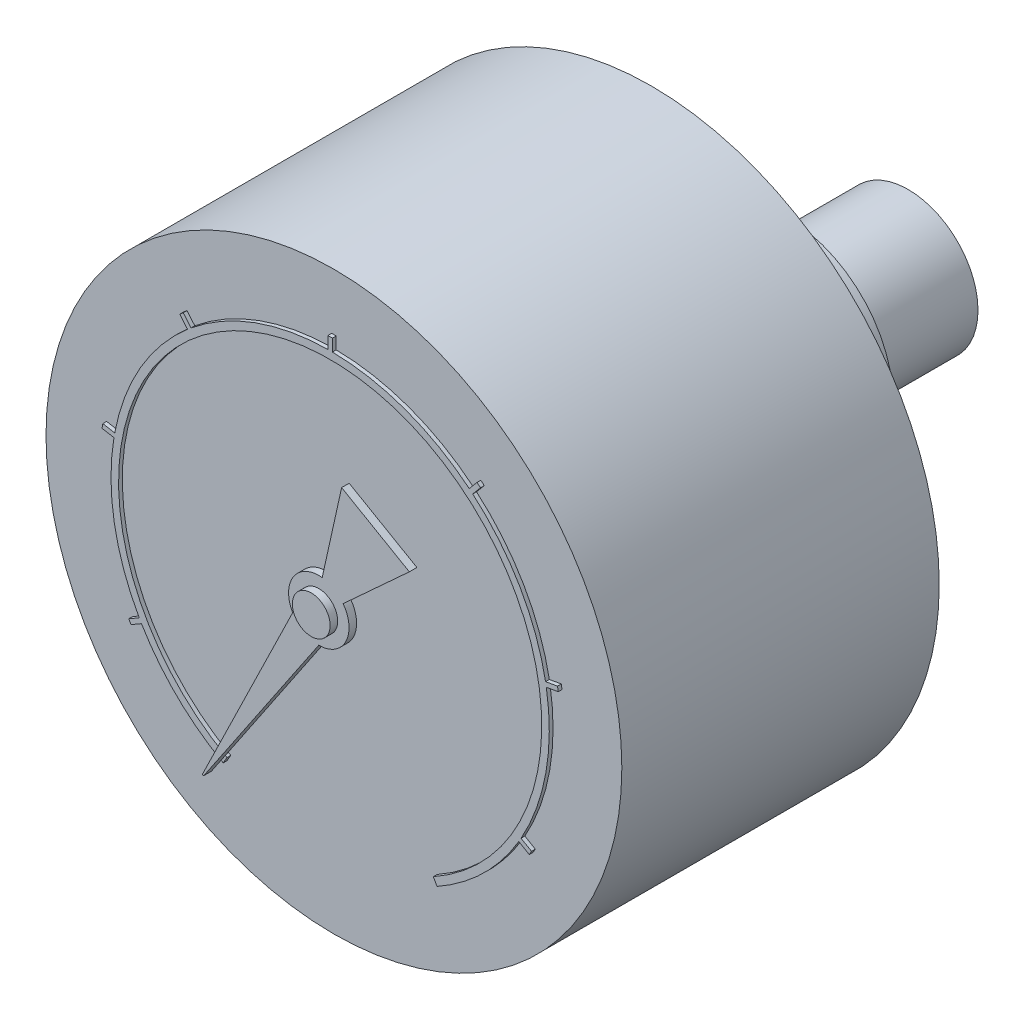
ISO-10303-21;
HEADER;
FILE_DESCRIPTION(('STEP AP214'),'2;1');
FILE_NAME('part.step','',(''),(''),'','','');
FILE_SCHEMA(('AUTOMOTIVE_DESIGN { 1 0 10303 214 1 1 1 1 }'));
ENDSEC;
DATA;
#1=APPLICATION_CONTEXT('core data for automotive mechanical design processes');
#2=APPLICATION_PROTOCOL_DEFINITION('international standard','automotive_design',2000,#1);
#3=PRODUCT_CONTEXT('',#1,'mechanical');
#4=PRODUCT('Part','Part','',(#3));
#5=PRODUCT_RELATED_PRODUCT_CATEGORY('part','',(#4));
#6=PRODUCT_DEFINITION_FORMATION('','',#4);
#7=PRODUCT_DEFINITION_CONTEXT('part definition',#1,'design');
#8=PRODUCT_DEFINITION('design','',#6,#7);
#9=PRODUCT_DEFINITION_SHAPE('','',#8);
#10=(LENGTH_UNIT() NAMED_UNIT(*) SI_UNIT(.MILLI.,.METRE.));
#11=(NAMED_UNIT(*) PLANE_ANGLE_UNIT() SI_UNIT($,.RADIAN.));
#12=(NAMED_UNIT(*) SI_UNIT($,.STERADIAN.) SOLID_ANGLE_UNIT());
#13=UNCERTAINTY_MEASURE_WITH_UNIT(LENGTH_MEASURE(1.E-05),#10,'distance_accuracy_value','');
#14=(GEOMETRIC_REPRESENTATION_CONTEXT(3) GLOBAL_UNCERTAINTY_ASSIGNED_CONTEXT((#13)) GLOBAL_UNIT_ASSIGNED_CONTEXT((#10,
#11,#12)) REPRESENTATION_CONTEXT('',''));
#15=CARTESIAN_POINT('',(0.,0.,0.));
#16=DIRECTION('',(0.,0.,1.));
#17=DIRECTION('',(1.,0.,0.));
#18=AXIS2_PLACEMENT_3D('',#15,#16,#17);
#19=CARTESIAN_POINT('',(0.,0.,31.5));
#20=DIRECTION('',(0.,0.,1.));
#21=DIRECTION('',(1.,0.,0.));
#22=AXIS2_PLACEMENT_3D('',#19,#20,#21);
#23=PLANE('',#22);
#24=CARTESIAN_POINT('',(0.,0.,31.5));
#25=DIRECTION('',(0.,0.,-1.));
#26=DIRECTION('',(-1.,0.,0.));
#27=AXIS2_PLACEMENT_3D('',#24,#25,#26);
#28=CIRCLE('',#27,1.25);
#29=CARTESIAN_POINT('',(-1.25,0.,31.5));
#30=VERTEX_POINT('',#29);
#31=EDGE_CURVE('E20',#30,#30,#28,.T.);
#32=ORIENTED_EDGE('',*,*,#31,.F.);
#33=EDGE_LOOP('',(#32));
#34=FACE_BOUND('',#33,.T.);
#35=ADVANCED_FACE('F17',(#34),#23,.T.);
#36=CARTESIAN_POINT('',(0.,0.,31.5));
#37=DIRECTION('',(0.,0.,-1.));
#38=DIRECTION('',(-1.,0.,0.));
#39=AXIS2_PLACEMENT_3D('',#36,#37,#38);
#40=CYLINDRICAL_SURFACE('',#39,1.25);
#41=CARTESIAN_POINT('',(0.,0.,30.9999999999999));
#42=DIRECTION('',(0.,0.,-1.));
#43=DIRECTION('',(-1.,0.,0.));
#44=AXIS2_PLACEMENT_3D('',#41,#42,#43);
#45=CIRCLE('',#44,1.25);
#46=CARTESIAN_POINT('',(-1.25,0.,30.9999999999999));
#47=VERTEX_POINT('',#46);
#48=EDGE_CURVE('E434',#47,#47,#45,.F.);
#49=ORIENTED_EDGE('',*,*,#48,.T.);
#50=EDGE_LOOP('',(#49));
#51=FACE_BOUND('',#50,.T.);
#52=ORIENTED_EDGE('',*,*,#31,.T.);
#53=EDGE_LOOP('',(#52));
#54=FACE_BOUND('',#53,.T.);
#55=ADVANCED_FACE('F441',(#51,#54),#40,.T.);
#56=CARTESIAN_POINT('',(0.,0.,-8.));
#57=DIRECTION('',(0.,0.,-1.));
#58=DIRECTION('',(-1.,0.,0.));
#59=AXIS2_PLACEMENT_3D('',#56,#57,#58);
#60=PLANE('',#59);
#61=CARTESIAN_POINT('',(0.,0.,-8.));
#62=DIRECTION('',(0.,0.,1.));
#63=DIRECTION('',(1.,0.,0.));
#64=AXIS2_PLACEMENT_3D('',#61,#62,#63);
#65=CIRCLE('',#64,4.61500000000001);
#66=CARTESIAN_POINT('',(4.61500000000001,0.,-8.));
#67=VERTEX_POINT('',#66);
#68=EDGE_CURVE('E282',#67,#67,#65,.T.);
#69=ORIENTED_EDGE('',*,*,#68,.F.);
#70=EDGE_LOOP('',(#69));
#71=FACE_BOUND('',#70,.T.);
#72=ADVANCED_FACE('F448',(#71),#60,.T.);
#73=CARTESIAN_POINT('',(-7.64161032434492,-13.2356573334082,30.9999999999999));
#74=DIRECTION('',(0.,0.,-1.));
#75=DIRECTION('',(-1.,0.,0.));
#76=AXIS2_PLACEMENT_3D('',#73,#74,#75);
#77=PLANE('',#76);
#78=ORIENTED_EDGE('',*,*,#48,.F.);
#79=EDGE_LOOP('',(#78));
#80=FACE_BOUND('',#79,.T.);
#81=DIRECTION('',(-0.559192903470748,-0.829037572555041,0.));
#82=VECTOR('',#81,1.);
#83=CARTESIAN_POINT('',(-0.002751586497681,-1.99999810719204,30.9999999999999));
#84=LINE('',#83,#82);
#85=CARTESIAN_POINT('',(-7.60015844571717,-13.2636169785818,30.9999999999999));
#86=VERTEX_POINT('',#85);
#87=CARTESIAN_POINT('',(-0.00275158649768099,-1.99999810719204,30.9999999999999));
#88=VERTEX_POINT('',#87);
#89=EDGE_CURVE('E276',#86,#88,#84,.F.);
#90=ORIENTED_EDGE('',*,*,#89,.T.);
#91=CARTESIAN_POINT('',(0.,0.,30.9999999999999));
#92=DIRECTION('',(0.,0.,-1.));
#93=DIRECTION('',(-1.,0.,0.));
#94=AXIS2_PLACEMENT_3D('',#91,#92,#93);
#95=CIRCLE('',#94,2.);
#96=CARTESIAN_POINT('',(1.60933546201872,1.18745078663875,30.9999999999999));
#97=VERTEX_POINT('',#96);
#98=EDGE_CURVE('E292',#97,#88,#95,.T.);
#99=ORIENTED_EDGE('',*,*,#98,.F.);
#100=DIRECTION('',(-0.737277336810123,-0.675590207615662,0.));
#101=VECTOR('',#100,1.);
#102=CARTESIAN_POINT('',(1.60933546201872,1.18745078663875,30.9999999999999));
#103=LINE('',#102,#101);
#104=CARTESIAN_POINT('',(5.99022471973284,5.20179618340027,30.9999999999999));
#105=VERTEX_POINT('',#104);
#106=EDGE_CURVE('E304',#97,#105,#103,.F.);
#107=ORIENTED_EDGE('',*,*,#106,.T.);
#108=DIRECTION('',(0.866025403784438,-0.500000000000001,0.));
#109=VECTOR('',#108,1.);
#110=CARTESIAN_POINT('',(5.99022471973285,5.20179618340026,30.9999999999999));
#111=LINE('',#110,#109);
#112=CARTESIAN_POINT('',(1.50977528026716,7.78858487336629,30.9999999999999));
#113=VERTEX_POINT('',#112);
#114=EDGE_CURVE('E310',#105,#113,#111,.F.);
#115=ORIENTED_EDGE('',*,*,#114,.T.);
#116=DIRECTION('',(0.216439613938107,0.976296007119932,0.));
#117=VECTOR('',#116,1.);
#118=CARTESIAN_POINT('',(1.50977528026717,7.78858487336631,30.9999999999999));
#119=LINE('',#118,#117);
#120=CARTESIAN_POINT('',(0.223694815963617,1.98745078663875,30.9999999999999));
#121=VERTEX_POINT('',#120);
#122=EDGE_CURVE('E315',#113,#121,#119,.F.);
#123=ORIENTED_EDGE('',*,*,#122,.T.);
#124=CARTESIAN_POINT('',(0.,0.,30.9999999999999));
#125=DIRECTION('',(0.,0.,-1.));
#126=DIRECTION('',(-1.,0.,0.));
#127=AXIS2_PLACEMENT_3D('',#124,#125,#126);
#128=CIRCLE('',#127,2.);
#129=CARTESIAN_POINT('',(-1.73067337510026,-1.00238199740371,30.9999999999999));
#130=VERTEX_POINT('',#129);
#131=EDGE_CURVE('E430',#130,#121,#128,.T.);
#132=ORIENTED_EDGE('',*,*,#131,.F.);
#133=DIRECTION('',(0.438371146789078,0.898794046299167,0.));
#134=VECTOR('',#133,1.);
#135=CARTESIAN_POINT('',(-7.68655002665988,-13.2137387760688,30.9999999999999));
#136=LINE('',#135,#134);
#137=CARTESIAN_POINT('',(-7.68655002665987,-13.2137387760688,30.9999999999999));
#138=VERTEX_POINT('',#137);
#139=EDGE_CURVE('E279',#130,#138,#136,.F.);
#140=ORIENTED_EDGE('',*,*,#139,.T.);
#141=CARTESIAN_POINT('',(-7.64161032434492,-13.2356573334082,30.9999999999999));
#142=DIRECTION('',(0.,0.,-1.));
#143=DIRECTION('',(-1.,0.,0.));
#144=AXIS2_PLACEMENT_3D('',#141,#142,#143);
#145=CIRCLE('',#144,0.0499999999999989);
#146=EDGE_CURVE('E271',#86,#138,#145,.T.);
#147=ORIENTED_EDGE('',*,*,#146,.F.);
#148=EDGE_LOOP('',(#90,#99,#107,#115,#123,#132,#140,#147));
#149=FACE_BOUND('',#148,.T.);
#150=ADVANCED_FACE('F273',(#80,#149),#77,.F.);
#151=CARTESIAN_POINT('',(0.,0.,-8.));
#152=DIRECTION('',(0.,0.,1.));
#153=DIRECTION('',(1.,0.,0.));
#154=AXIS2_PLACEMENT_3D('',#151,#152,#153);
#155=CYLINDRICAL_SURFACE('',#154,4.61500000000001);
#156=CARTESIAN_POINT('',(0.,0.,0.));
#157=DIRECTION('',(0.,0.,1.));
#158=DIRECTION('',(1.,0.,0.));
#159=AXIS2_PLACEMENT_3D('',#156,#157,#158);
#160=CIRCLE('',#159,4.61500000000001);
#161=CARTESIAN_POINT('',(4.61500000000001,0.,0.));
#162=VERTEX_POINT('',#161);
#163=EDGE_CURVE('E298',#162,#162,#160,.F.);
#164=ORIENTED_EDGE('',*,*,#163,.T.);
#165=EDGE_LOOP('',(#164));
#166=FACE_BOUND('',#165,.T.);
#167=ORIENTED_EDGE('',*,*,#68,.T.);
#168=EDGE_LOOP('',(#167));
#169=FACE_BOUND('',#168,.T.);
#170=ADVANCED_FACE('F640',(#166,#169),#155,.T.);
#171=CARTESIAN_POINT('',(-7.64161032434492,-13.2356573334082,30.9999999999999));
#172=DIRECTION('',(0.,0.,-1.));
#173=DIRECTION('',(-1.,0.,0.));
#174=AXIS2_PLACEMENT_3D('',#171,#172,#173);
#175=CYLINDRICAL_SURFACE('',#174,0.0499999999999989);
#176=CARTESIAN_POINT('',(-7.64161032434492,-13.2356573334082,30.4999999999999));
#177=DIRECTION('',(0.,0.,-1.));
#178=DIRECTION('',(-1.,0.,0.));
#179=AXIS2_PLACEMENT_3D('',#176,#177,#178);
#180=CIRCLE('',#179,0.0499999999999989);
#181=CARTESIAN_POINT('',(-7.60015844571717,-13.2636169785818,30.4999999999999));
#182=VERTEX_POINT('',#181);
#183=CARTESIAN_POINT('',(-7.68655002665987,-13.2137387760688,30.4999999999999));
#184=VERTEX_POINT('',#183);
#185=EDGE_CURVE('E288',#182,#184,#180,.T.);
#186=ORIENTED_EDGE('',*,*,#185,.F.);
#187=DIRECTION('',(0.,0.,1.));
#188=VECTOR('',#187,1.);
#189=CARTESIAN_POINT('',(-7.60015844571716,-13.2636169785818,30.9999999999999));
#190=LINE('',#189,#188);
#191=EDGE_CURVE('E285',#182,#86,#190,.T.);
#192=ORIENTED_EDGE('',*,*,#191,.T.);
#193=ORIENTED_EDGE('',*,*,#146,.T.);
#194=DIRECTION('',(0.,0.,1.));
#195=VECTOR('',#194,1.);
#196=CARTESIAN_POINT('',(-7.68655002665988,-13.2137387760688,30.9999999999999));
#197=LINE('',#196,#195);
#198=EDGE_CURVE('E302',#138,#184,#197,.F.);
#199=ORIENTED_EDGE('',*,*,#198,.T.);
#200=EDGE_LOOP('',(#186,#192,#193,#199));
#201=FACE_BOUND('',#200,.T.);
#202=ADVANCED_FACE('F286',(#201),#175,.T.);
#203=CARTESIAN_POINT('',(-7.68655002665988,-13.2137387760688,30.9999999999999));
#204=DIRECTION('',(0.898794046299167,-0.438371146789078,0.));
#205=DIRECTION('',(0.438371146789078,0.898794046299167,0.));
#206=AXIS2_PLACEMENT_3D('',#203,#204,#205);
#207=PLANE('',#206);
#208=ORIENTED_EDGE('',*,*,#198,.F.);
#209=ORIENTED_EDGE('',*,*,#139,.F.);
#210=DIRECTION('',(0.,0.,-1.));
#211=VECTOR('',#210,1.);
#212=CARTESIAN_POINT('',(-1.73067337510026,-1.00238199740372,30.9999999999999));
#213=LINE('',#212,#211);
#214=CARTESIAN_POINT('',(-1.73067337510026,-1.00238199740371,30.4999999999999));
#215=VERTEX_POINT('',#214);
#216=EDGE_CURVE('E317',#215,#130,#213,.F.);
#217=ORIENTED_EDGE('',*,*,#216,.F.);
#218=DIRECTION('',(0.438371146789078,0.898794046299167,0.));
#219=VECTOR('',#218,1.);
#220=CARTESIAN_POINT('',(-7.68655002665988,-13.2137387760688,30.4999999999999));
#221=LINE('',#220,#219);
#222=EDGE_CURVE('E424',#184,#215,#221,.T.);
#223=ORIENTED_EDGE('',*,*,#222,.F.);
#224=EDGE_LOOP('',(#208,#209,#217,#223));
#225=FACE_BOUND('',#224,.T.);
#226=ADVANCED_FACE('F633',(#225),#207,.F.);
#227=CARTESIAN_POINT('',(0.,0.,30.9999999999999));
#228=DIRECTION('',(0.,0.,-1.));
#229=DIRECTION('',(-1.,0.,0.));
#230=AXIS2_PLACEMENT_3D('',#227,#228,#229);
#231=CYLINDRICAL_SURFACE('',#230,2.);
#232=CARTESIAN_POINT('',(0.,0.,30.4999999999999));
#233=DIRECTION('',(0.,0.,-1.));
#234=DIRECTION('',(-1.,0.,0.));
#235=AXIS2_PLACEMENT_3D('',#232,#233,#234);
#236=CIRCLE('',#235,2.);
#237=CARTESIAN_POINT('',(0.223694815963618,1.98745078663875,30.4999999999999));
#238=VERTEX_POINT('',#237);
#239=EDGE_CURVE('E420',#215,#238,#236,.T.);
#240=ORIENTED_EDGE('',*,*,#239,.F.);
#241=ORIENTED_EDGE('',*,*,#216,.T.);
#242=ORIENTED_EDGE('',*,*,#131,.T.);
#243=DIRECTION('',(0.,0.,1.));
#244=VECTOR('',#243,1.);
#245=CARTESIAN_POINT('',(0.223694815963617,1.98745078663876,30.9999999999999));
#246=LINE('',#245,#244);
#247=EDGE_CURVE('E312',#121,#238,#246,.F.);
#248=ORIENTED_EDGE('',*,*,#247,.T.);
#249=EDGE_LOOP('',(#240,#241,#242,#248));
#250=FACE_BOUND('',#249,.T.);
#251=ADVANCED_FACE('F629',(#250),#231,.T.);
#252=CARTESIAN_POINT('',(1.50977528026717,7.78858487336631,30.9999999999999));
#253=DIRECTION('',(0.976296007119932,-0.216439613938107,0.));
#254=DIRECTION('',(0.216439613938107,0.976296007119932,0.));
#255=AXIS2_PLACEMENT_3D('',#252,#253,#254);
#256=PLANE('',#255);
#257=ORIENTED_EDGE('',*,*,#247,.F.);
#258=ORIENTED_EDGE('',*,*,#122,.F.);
#259=DIRECTION('',(0.,0.,1.));
#260=VECTOR('',#259,1.);
#261=CARTESIAN_POINT('',(1.50977528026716,7.78858487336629,30.9999999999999));
#262=LINE('',#261,#260);
#263=CARTESIAN_POINT('',(1.50977528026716,7.7885848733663,30.4999999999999));
#264=VERTEX_POINT('',#263);
#265=EDGE_CURVE('E307',#113,#264,#262,.F.);
#266=ORIENTED_EDGE('',*,*,#265,.T.);
#267=DIRECTION('',(0.216439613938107,0.976296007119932,0.));
#268=VECTOR('',#267,1.);
#269=CARTESIAN_POINT('',(0.223694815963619,1.98745078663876,30.4999999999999));
#270=LINE('',#269,#268);
#271=EDGE_CURVE('E423',#238,#264,#270,.T.);
#272=ORIENTED_EDGE('',*,*,#271,.F.);
#273=EDGE_LOOP('',(#257,#258,#266,#272));
#274=FACE_BOUND('',#273,.T.);
#275=ADVANCED_FACE('F625',(#274),#256,.F.);
#276=CARTESIAN_POINT('',(5.99022471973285,5.20179618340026,30.9999999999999));
#277=DIRECTION('',(-0.500000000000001,-0.866025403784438,0.));
#278=DIRECTION('',(0.866025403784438,-0.500000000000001,0.));
#279=AXIS2_PLACEMENT_3D('',#276,#277,#278);
#280=PLANE('',#279);
#281=ORIENTED_EDGE('',*,*,#265,.F.);
#282=ORIENTED_EDGE('',*,*,#114,.F.);
#283=DIRECTION('',(0.,0.,1.));
#284=VECTOR('',#283,1.);
#285=CARTESIAN_POINT('',(5.99022471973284,5.20179618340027,30.9999999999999));
#286=LINE('',#285,#284);
#287=CARTESIAN_POINT('',(5.99022471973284,5.20179618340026,30.4999999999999));
#288=VERTEX_POINT('',#287);
#289=EDGE_CURVE('E306',#105,#288,#286,.F.);
#290=ORIENTED_EDGE('',*,*,#289,.T.);
#291=DIRECTION('',(0.866025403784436,-0.500000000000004,0.));
#292=VECTOR('',#291,1.);
#293=CARTESIAN_POINT('',(1.50977528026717,7.78858487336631,30.4999999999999));
#294=LINE('',#293,#292);
#295=EDGE_CURVE('E1074',#264,#288,#294,.T.);
#296=ORIENTED_EDGE('',*,*,#295,.F.);
#297=EDGE_LOOP('',(#281,#282,#290,#296));
#298=FACE_BOUND('',#297,.T.);
#299=ADVANCED_FACE('F621',(#298),#280,.F.);
#300=CARTESIAN_POINT('',(1.60933546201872,1.18745078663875,30.9999999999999));
#301=DIRECTION('',(-0.675590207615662,0.737277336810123,0.));
#302=DIRECTION('',(-0.737277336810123,-0.675590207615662,0.));
#303=AXIS2_PLACEMENT_3D('',#300,#301,#302);
#304=PLANE('',#303);
#305=ORIENTED_EDGE('',*,*,#289,.F.);
#306=ORIENTED_EDGE('',*,*,#106,.F.);
#307=DIRECTION('',(0.,0.,-1.));
#308=VECTOR('',#307,1.);
#309=CARTESIAN_POINT('',(1.60933546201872,1.18745078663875,30.9999999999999));
#310=LINE('',#309,#308);
#311=CARTESIAN_POINT('',(1.60933546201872,1.18745078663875,30.4999999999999));
#312=VERTEX_POINT('',#311);
#313=EDGE_CURVE('E429',#312,#97,#310,.F.);
#314=ORIENTED_EDGE('',*,*,#313,.F.);
#315=DIRECTION('',(-0.737277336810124,-0.675590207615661,0.));
#316=VECTOR('',#315,1.);
#317=CARTESIAN_POINT('',(5.99022471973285,5.20179618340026,30.4999999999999));
#318=LINE('',#317,#316);
#319=EDGE_CURVE('E419',#288,#312,#318,.T.);
#320=ORIENTED_EDGE('',*,*,#319,.F.);
#321=EDGE_LOOP('',(#305,#306,#314,#320));
#322=FACE_BOUND('',#321,.T.);
#323=ADVANCED_FACE('F617',(#322),#304,.F.);
#324=CARTESIAN_POINT('',(0.,0.,30.9999999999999));
#325=DIRECTION('',(0.,0.,-1.));
#326=DIRECTION('',(-1.,0.,0.));
#327=AXIS2_PLACEMENT_3D('',#324,#325,#326);
#328=CYLINDRICAL_SURFACE('',#327,2.);
#329=ORIENTED_EDGE('',*,*,#98,.T.);
#330=DIRECTION('',(0.,0.,1.));
#331=VECTOR('',#330,1.);
#332=CARTESIAN_POINT('',(-0.002751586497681,-1.99999810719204,30.9999999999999));
#333=LINE('',#332,#331);
#334=CARTESIAN_POINT('',(-0.00275158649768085,-1.99999810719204,30.4999999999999));
#335=VERTEX_POINT('',#334);
#336=EDGE_CURVE('E296',#88,#335,#333,.F.);
#337=ORIENTED_EDGE('',*,*,#336,.T.);
#338=CARTESIAN_POINT('',(0.,0.,30.4999999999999));
#339=DIRECTION('',(0.,0.,-1.));
#340=DIRECTION('',(-1.,0.,0.));
#341=AXIS2_PLACEMENT_3D('',#338,#339,#340);
#342=CIRCLE('',#341,2.);
#343=EDGE_CURVE('E415',#312,#335,#342,.T.);
#344=ORIENTED_EDGE('',*,*,#343,.F.);
#345=ORIENTED_EDGE('',*,*,#313,.T.);
#346=EDGE_LOOP('',(#329,#337,#344,#345));
#347=FACE_BOUND('',#346,.T.);
#348=ADVANCED_FACE('F614',(#347),#328,.T.);
#349=CARTESIAN_POINT('',(-0.002751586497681,-1.99999810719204,30.9999999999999));
#350=DIRECTION('',(-0.829037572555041,0.559192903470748,0.));
#351=DIRECTION('',(-0.559192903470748,-0.829037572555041,0.));
#352=AXIS2_PLACEMENT_3D('',#349,#350,#351);
#353=PLANE('',#352);
#354=ORIENTED_EDGE('',*,*,#336,.F.);
#355=ORIENTED_EDGE('',*,*,#89,.F.);
#356=ORIENTED_EDGE('',*,*,#191,.F.);
#357=DIRECTION('',(-0.559192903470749,-0.82903757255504,0.));
#358=VECTOR('',#357,1.);
#359=CARTESIAN_POINT('',(-0.00275158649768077,-1.99999810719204,30.4999999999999));
#360=LINE('',#359,#358);
#361=EDGE_CURVE('E418',#335,#182,#360,.T.);
#362=ORIENTED_EDGE('',*,*,#361,.F.);
#363=EDGE_LOOP('',(#354,#355,#356,#362));
#364=FACE_BOUND('',#363,.T.);
#365=ADVANCED_FACE('F295',(#364),#353,.F.);
#366=CARTESIAN_POINT('',(0.,0.,0.));
#367=DIRECTION('',(0.,0.,1.));
#368=DIRECTION('',(1.,0.,0.));
#369=AXIS2_PLACEMENT_3D('',#366,#367,#368);
#370=PLANE('',#369);
#371=ORIENTED_EDGE('',*,*,#163,.F.);
#372=EDGE_LOOP('',(#371));
#373=FACE_BOUND('',#372,.T.);
#374=CARTESIAN_POINT('',(0.,0.,0.));
#375=DIRECTION('',(0.,0.,1.));
#376=DIRECTION('',(1.,0.,0.));
#377=AXIS2_PLACEMENT_3D('',#374,#375,#376);
#378=CIRCLE('',#377,6.99999999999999);
#379=CARTESIAN_POINT('',(6.99999999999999,0.,0.));
#380=VERTEX_POINT('',#379);
#381=EDGE_CURVE('E411',#380,#380,#378,.T.);
#382=ORIENTED_EDGE('',*,*,#381,.F.);
#383=EDGE_LOOP('',(#382));
#384=FACE_BOUND('',#383,.T.);
#385=ADVANCED_FACE('F607',(#373,#384),#370,.F.);
#386=CARTESIAN_POINT('',(-7.64161032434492,-13.2356573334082,30.4999999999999));
#387=DIRECTION('',(0.,0.,-1.));
#388=DIRECTION('',(-1.,0.,0.));
#389=AXIS2_PLACEMENT_3D('',#386,#387,#388);
#390=PLANE('',#389);
#391=CARTESIAN_POINT('',(0.,0.,30.4999999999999));
#392=DIRECTION('',(0.,0.,-1.));
#393=DIRECTION('',(-1.,0.,0.));
#394=AXIS2_PLACEMENT_3D('',#391,#392,#393);
#395=CIRCLE('',#394,1.25);
#396=CARTESIAN_POINT('',(-1.25,0.,30.4999999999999));
#397=VERTEX_POINT('',#396);
#398=EDGE_CURVE('E408',#397,#397,#395,.T.);
#399=ORIENTED_EDGE('',*,*,#398,.F.);
#400=EDGE_LOOP('',(#399));
#401=FACE_BOUND('',#400,.T.);
#402=ORIENTED_EDGE('',*,*,#343,.T.);
#403=ORIENTED_EDGE('',*,*,#361,.T.);
#404=ORIENTED_EDGE('',*,*,#185,.T.);
#405=ORIENTED_EDGE('',*,*,#222,.T.);
#406=ORIENTED_EDGE('',*,*,#239,.T.);
#407=ORIENTED_EDGE('',*,*,#271,.T.);
#408=ORIENTED_EDGE('',*,*,#295,.T.);
#409=ORIENTED_EDGE('',*,*,#319,.T.);
#410=EDGE_LOOP('',(#402,#403,#404,#405,#406,#407,#408,#409));
#411=FACE_BOUND('',#410,.T.);
#412=ADVANCED_FACE('F603',(#401,#411),#390,.T.);
#413=CARTESIAN_POINT('',(0.,0.,30.2499999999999));
#414=DIRECTION('',(0.,0.,1.));
#415=DIRECTION('',(1.,0.,0.));
#416=AXIS2_PLACEMENT_3D('',#413,#414,#415);
#417=PLANE('',#416);
#418=CARTESIAN_POINT('',(0.,0.,30.2499999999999));
#419=DIRECTION('',(0.,0.,-1.));
#420=DIRECTION('',(-1.,0.,0.));
#421=AXIS2_PLACEMENT_3D('',#418,#419,#420);
#422=CIRCLE('',#421,14.5);
#423=CARTESIAN_POINT('',(-7.0761052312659,-12.6561737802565,30.2499999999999));
#424=VERTEX_POINT('',#423);
#425=CARTESIAN_POINT('',(-12.4816964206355,-7.37951586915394,30.2499999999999));
#426=VERTEX_POINT('',#425);
#427=EDGE_CURVE('E373',#424,#426,#422,.T.);
#428=ORIENTED_EDGE('',*,*,#427,.F.);
#429=DIRECTION('',(-0.500000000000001,-0.866025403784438,0.));
#430=VECTOR('',#429,1.);
#431=CARTESIAN_POINT('',(-6.82608059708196,-12.2231184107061,30.2499999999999));
#432=LINE('',#431,#430);
#433=CARTESIAN_POINT('',(-6.82608059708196,-12.2231184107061,30.2499999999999));
#434=VERTEX_POINT('',#433);
#435=EDGE_CURVE('E1204',#424,#434,#432,.F.);
#436=ORIENTED_EDGE('',*,*,#435,.T.);
#437=CARTESIAN_POINT('',(0.,0.,30.2499999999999));
#438=DIRECTION('',(0.,0.,-1.));
#439=DIRECTION('',(-1.,0.,0.));
#440=AXIS2_PLACEMENT_3D('',#437,#438,#439);
#441=CIRCLE('',#440,14.);
#442=CARTESIAN_POINT('',(6.82608059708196,-12.2231184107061,30.2499999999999));
#443=VERTEX_POINT('',#442);
#444=EDGE_CURVE('E369',#434,#443,#441,.T.);
#445=ORIENTED_EDGE('',*,*,#444,.T.);
#446=DIRECTION('',(-0.500000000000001,0.866025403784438,0.));
#447=VECTOR('',#446,1.);
#448=CARTESIAN_POINT('',(6.82608059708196,-12.2231184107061,30.2499999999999));
#449=LINE('',#448,#447);
#450=CARTESIAN_POINT('',(7.0761052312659,-12.6561737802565,30.2499999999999));
#451=VERTEX_POINT('',#450);
#452=EDGE_CURVE('E368',#443,#451,#449,.F.);
#453=ORIENTED_EDGE('',*,*,#452,.T.);
#454=CARTESIAN_POINT('',(0.,0.,30.2499999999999));
#455=DIRECTION('',(0.,0.,-1.));
#456=DIRECTION('',(-1.,0.,0.));
#457=AXIS2_PLACEMENT_3D('',#454,#455,#456);
#458=CIRCLE('',#457,14.5);
#459=CARTESIAN_POINT('',(12.4816964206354,-7.37951586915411,30.2499999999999));
#460=VERTEX_POINT('',#459);
#461=EDGE_CURVE('E364',#460,#451,#458,.T.);
#462=ORIENTED_EDGE('',*,*,#461,.F.);
#463=DIRECTION('',(0.866025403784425,-0.500000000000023,0.));
#464=VECTOR('',#463,1.);
#465=CARTESIAN_POINT('',(12.4816964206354,-7.37951586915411,30.2499999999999));
#466=LINE('',#465,#464);
#467=CARTESIAN_POINT('',(13.1745167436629,-7.77951586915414,30.2499999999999));
#468=VERTEX_POINT('',#467);
#469=EDGE_CURVE('E1065',#460,#468,#466,.T.);
#470=ORIENTED_EDGE('',*,*,#469,.T.);
#471=DIRECTION('',(0.499999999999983,0.866025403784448,0.));
#472=VECTOR('',#471,1.);
#473=CARTESIAN_POINT('',(13.1745167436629,-7.77951586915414,30.2499999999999));
#474=LINE('',#473,#472);
#475=CARTESIAN_POINT('',(13.324516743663,-7.51970824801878,30.2499999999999));
#476=VERTEX_POINT('',#475);
#477=EDGE_CURVE('E414',#468,#476,#474,.T.);
#478=ORIENTED_EDGE('',*,*,#477,.T.);
#479=DIRECTION('',(-0.866025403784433,0.50000000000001,0.));
#480=VECTOR('',#479,1.);
#481=CARTESIAN_POINT('',(13.3245167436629,-7.51970824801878,30.2499999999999));
#482=LINE('',#481,#480);
#483=CARTESIAN_POINT('',(12.6316964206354,-7.11970824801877,30.2499999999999));
#484=VERTEX_POINT('',#483);
#485=EDGE_CURVE('E407',#484,#476,#482,.F.);
#486=ORIENTED_EDGE('',*,*,#485,.F.);
#487=CARTESIAN_POINT('',(0.,0.,30.2499999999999));
#488=DIRECTION('',(0.,0.,-1.));
#489=DIRECTION('',(-1.,0.,0.));
#490=AXIS2_PLACEMENT_3D('',#487,#488,#489);
#491=CIRCLE('',#490,14.5);
#492=CARTESIAN_POINT('',(14.3049955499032,2.37004268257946,30.2499999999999));
#493=VERTEX_POINT('',#492);
#494=EDGE_CURVE('E403',#493,#484,#491,.T.);
#495=ORIENTED_EDGE('',*,*,#494,.F.);
#496=DIRECTION('',(0.98480775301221,0.17364817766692,0.));
#497=VECTOR('',#496,1.);
#498=CARTESIAN_POINT('',(14.3049955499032,2.37004268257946,30.2499999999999));
#499=LINE('',#498,#497);
#500=CARTESIAN_POINT('',(15.092841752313,2.50896122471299,30.2499999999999));
#501=VERTEX_POINT('',#500);
#502=EDGE_CURVE('E1104',#501,#493,#499,.F.);
#503=ORIENTED_EDGE('',*,*,#502,.F.);
#504=DIRECTION('',(-0.17364817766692,0.98480775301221,0.));
#505=VECTOR('',#504,1.);
#506=CARTESIAN_POINT('',(15.092841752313,2.508961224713,30.2499999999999));
#507=LINE('',#506,#505);
#508=CARTESIAN_POINT('',(15.0407472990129,2.80440355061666,30.2499999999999));
#509=VERTEX_POINT('',#508);
#510=EDGE_CURVE('E1111',#509,#501,#507,.F.);
#511=ORIENTED_EDGE('',*,*,#510,.F.);
#512=DIRECTION('',(-0.98480775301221,-0.17364817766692,0.));
#513=VECTOR('',#512,1.);
#514=CARTESIAN_POINT('',(15.0407472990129,2.80440355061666,30.2499999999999));
#515=LINE('',#514,#513);
#516=CARTESIAN_POINT('',(14.2529010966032,2.66548500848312,30.2499999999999));
#517=VERTEX_POINT('',#516);
#518=EDGE_CURVE('E402',#517,#509,#515,.F.);
#519=ORIENTED_EDGE('',*,*,#518,.F.);
#520=CARTESIAN_POINT('',(0.,0.,30.2499999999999));
#521=DIRECTION('',(0.,0.,-1.));
#522=DIRECTION('',(-1.,0.,0.));
#523=AXIS2_PLACEMENT_3D('',#520,#521,#522);
#524=CIRCLE('',#523,14.5);
#525=CARTESIAN_POINT('',(9.43482827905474,11.0106319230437,30.2499999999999));
#526=VERTEX_POINT('',#525);
#527=EDGE_CURVE('E398',#526,#517,#524,.T.);
#528=ORIENTED_EDGE('',*,*,#527,.F.);
#529=DIRECTION('',(0.642787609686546,0.766044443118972,0.));
#530=VECTOR('',#529,1.);
#531=CARTESIAN_POINT('',(9.43482827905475,11.0106319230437,30.2499999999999));
#532=LINE('',#531,#530);
#533=CARTESIAN_POINT('',(9.94905836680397,11.6234674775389,30.2499999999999));
#534=VERTEX_POINT('',#533);
#535=EDGE_CURVE('E1121',#534,#526,#532,.F.);
#536=ORIENTED_EDGE('',*,*,#535,.F.);
#537=DIRECTION('',(-0.766044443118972,0.642787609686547,0.));
#538=VECTOR('',#537,1.);
#539=CARTESIAN_POINT('',(9.94905836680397,11.6234674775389,30.2499999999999));
#540=LINE('',#539,#538);
#541=CARTESIAN_POINT('',(9.71924503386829,11.8163037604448,30.2499999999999));
#542=VERTEX_POINT('',#541);
#543=EDGE_CURVE('E1128',#542,#534,#540,.F.);
#544=ORIENTED_EDGE('',*,*,#543,.F.);
#545=DIRECTION('',(-0.642787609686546,-0.766044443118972,0.));
#546=VECTOR('',#545,1.);
#547=CARTESIAN_POINT('',(9.71924503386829,11.8163037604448,30.2499999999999));
#548=LINE('',#547,#546);
#549=CARTESIAN_POINT('',(9.20501494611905,11.2034682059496,30.2499999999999));
#550=VERTEX_POINT('',#549);
#551=EDGE_CURVE('E397',#550,#542,#548,.F.);
#552=ORIENTED_EDGE('',*,*,#551,.F.);
#553=CARTESIAN_POINT('',(0.,0.,30.2499999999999));
#554=DIRECTION('',(0.,0.,-1.));
#555=DIRECTION('',(-1.,0.,0.));
#556=AXIS2_PLACEMENT_3D('',#553,#554,#555);
#557=CIRCLE('',#556,14.5);
#558=CARTESIAN_POINT('',(0.150000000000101,14.4992241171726,30.2499999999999));
#559=VERTEX_POINT('',#558);
#560=EDGE_CURVE('E393',#559,#550,#557,.T.);
#561=ORIENTED_EDGE('',*,*,#560,.F.);
#562=DIRECTION('',(0.,1.,0.));
#563=VECTOR('',#562,1.);
#564=CARTESIAN_POINT('',(0.150000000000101,14.4992241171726,30.2499999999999));
#565=LINE('',#564,#563);
#566=CARTESIAN_POINT('',(0.150000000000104,15.2992241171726,30.2499999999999));
#567=VERTEX_POINT('',#566);
#568=EDGE_CURVE('E1138',#567,#559,#565,.F.);
#569=ORIENTED_EDGE('',*,*,#568,.F.);
#570=DIRECTION('',(1.,0.,0.));
#571=VECTOR('',#570,1.);
#572=CARTESIAN_POINT('',(0.150000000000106,15.2992241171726,30.2499999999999));
#573=LINE('',#572,#571);
#574=CARTESIAN_POINT('',(-0.149999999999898,15.2992241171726,30.2499999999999));
#575=VERTEX_POINT('',#574);
#576=EDGE_CURVE('E1145',#575,#567,#573,.T.);
#577=ORIENTED_EDGE('',*,*,#576,.F.);
#578=DIRECTION('',(0.,1.,0.));
#579=VECTOR('',#578,1.);
#580=CARTESIAN_POINT('',(-0.149999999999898,15.2992241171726,30.2499999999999));
#581=LINE('',#580,#579);
#582=CARTESIAN_POINT('',(-0.1499999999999,14.4992241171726,30.2499999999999));
#583=VERTEX_POINT('',#582);
#584=EDGE_CURVE('E392',#583,#575,#581,.T.);
#585=ORIENTED_EDGE('',*,*,#584,.F.);
#586=CARTESIAN_POINT('',(0.,0.,30.2499999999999));
#587=DIRECTION('',(0.,0.,-1.));
#588=DIRECTION('',(-1.,0.,0.));
#589=AXIS2_PLACEMENT_3D('',#586,#587,#588);
#590=CIRCLE('',#589,14.5);
#591=CARTESIAN_POINT('',(-9.2050149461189,11.2034682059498,30.2499999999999));
#592=VERTEX_POINT('',#591);
#593=EDGE_CURVE('E388',#592,#583,#590,.T.);
#594=ORIENTED_EDGE('',*,*,#593,.F.);
#595=DIRECTION('',(-0.642787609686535,0.766044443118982,0.));
#596=VECTOR('',#595,1.);
#597=CARTESIAN_POINT('',(-9.20501494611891,11.2034682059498,30.2499999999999));
#598=LINE('',#597,#596);
#599=CARTESIAN_POINT('',(-9.71924503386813,11.816303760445,30.2499999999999));
#600=VERTEX_POINT('',#599);
#601=EDGE_CURVE('E1155',#600,#592,#598,.F.);
#602=ORIENTED_EDGE('',*,*,#601,.F.);
#603=DIRECTION('',(-0.766044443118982,-0.642787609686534,0.));
#604=VECTOR('',#603,1.);
#605=CARTESIAN_POINT('',(-9.71924503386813,11.816303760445,30.2499999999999));
#606=LINE('',#605,#604);
#607=CARTESIAN_POINT('',(-9.94905836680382,11.623467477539,30.2499999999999));
#608=VERTEX_POINT('',#607);
#609=EDGE_CURVE('E1162',#608,#600,#606,.F.);
#610=ORIENTED_EDGE('',*,*,#609,.F.);
#611=DIRECTION('',(0.642787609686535,-0.766044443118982,0.));
#612=VECTOR('',#611,1.);
#613=CARTESIAN_POINT('',(-9.94905836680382,11.623467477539,30.2499999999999));
#614=LINE('',#613,#612);
#615=CARTESIAN_POINT('',(-9.43482827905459,11.0106319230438,30.2499999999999));
#616=VERTEX_POINT('',#615);
#617=EDGE_CURVE('E387',#616,#608,#614,.F.);
#618=ORIENTED_EDGE('',*,*,#617,.F.);
#619=CARTESIAN_POINT('',(0.,0.,30.2499999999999));
#620=DIRECTION('',(0.,0.,-1.));
#621=DIRECTION('',(-1.,0.,0.));
#622=AXIS2_PLACEMENT_3D('',#619,#620,#621);
#623=CIRCLE('',#622,14.5);
#624=CARTESIAN_POINT('',(-14.2529010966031,2.66548500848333,30.2499999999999));
#625=VERTEX_POINT('',#624);
#626=EDGE_CURVE('E383',#625,#616,#623,.T.);
#627=ORIENTED_EDGE('',*,*,#626,.F.);
#628=DIRECTION('',(-0.984807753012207,0.173648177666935,0.));
#629=VECTOR('',#628,1.);
#630=CARTESIAN_POINT('',(-14.2529010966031,2.66548500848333,30.2499999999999));
#631=LINE('',#630,#629);
#632=CARTESIAN_POINT('',(-15.0407472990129,2.80440355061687,30.2499999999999));
#633=VERTEX_POINT('',#632);
#634=EDGE_CURVE('E1172',#633,#625,#631,.F.);
#635=ORIENTED_EDGE('',*,*,#634,.F.);
#636=DIRECTION('',(-0.173648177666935,-0.984807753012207,0.));
#637=VECTOR('',#636,1.);
#638=CARTESIAN_POINT('',(-15.0407472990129,2.80440355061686,30.2499999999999));
#639=LINE('',#638,#637);
#640=CARTESIAN_POINT('',(-15.092841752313,2.5089612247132,30.2499999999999));
#641=VERTEX_POINT('',#640);
#642=EDGE_CURVE('E1179',#641,#633,#639,.F.);
#643=ORIENTED_EDGE('',*,*,#642,.F.);
#644=DIRECTION('',(0.984807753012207,-0.173648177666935,0.));
#645=VECTOR('',#644,1.);
#646=CARTESIAN_POINT('',(-15.092841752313,2.5089612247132,30.2499999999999));
#647=LINE('',#646,#645);
#648=CARTESIAN_POINT('',(-14.3049955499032,2.37004268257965,30.2499999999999));
#649=VERTEX_POINT('',#648);
#650=EDGE_CURVE('E382',#649,#641,#647,.F.);
#651=ORIENTED_EDGE('',*,*,#650,.F.);
#652=CARTESIAN_POINT('',(0.,0.,30.2499999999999));
#653=DIRECTION('',(0.,0.,-1.));
#654=DIRECTION('',(-1.,0.,0.));
#655=AXIS2_PLACEMENT_3D('',#652,#653,#654);
#656=CIRCLE('',#655,14.5);
#657=CARTESIAN_POINT('',(-12.6316964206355,-7.1197082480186,30.2499999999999));
#658=VERTEX_POINT('',#657);
#659=EDGE_CURVE('E378',#658,#649,#656,.T.);
#660=ORIENTED_EDGE('',*,*,#659,.F.);
#661=DIRECTION('',(-0.86602540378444,-0.499999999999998,0.));
#662=VECTOR('',#661,1.);
#663=CARTESIAN_POINT('',(-12.6316964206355,-7.1197082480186,30.2499999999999));
#664=LINE('',#663,#662);
#665=CARTESIAN_POINT('',(-13.324516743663,-7.5197082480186,30.2499999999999));
#666=VERTEX_POINT('',#665);
#667=EDGE_CURVE('E1189',#666,#658,#664,.F.);
#668=ORIENTED_EDGE('',*,*,#667,.F.);
#669=DIRECTION('',(0.499999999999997,-0.86602540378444,0.));
#670=VECTOR('',#669,1.);
#671=CARTESIAN_POINT('',(-13.324516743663,-7.5197082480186,30.2499999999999));
#672=LINE('',#671,#670);
#673=CARTESIAN_POINT('',(-13.1745167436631,-7.77951586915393,30.2499999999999));
#674=VERTEX_POINT('',#673);
#675=EDGE_CURVE('E1196',#674,#666,#672,.F.);
#676=ORIENTED_EDGE('',*,*,#675,.F.);
#677=DIRECTION('',(0.86602540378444,0.499999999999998,0.));
#678=VECTOR('',#677,1.);
#679=CARTESIAN_POINT('',(-13.1745167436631,-7.77951586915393,30.2499999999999));
#680=LINE('',#679,#678);
#681=EDGE_CURVE('E377',#426,#674,#680,.F.);
#682=ORIENTED_EDGE('',*,*,#681,.F.);
#683=EDGE_LOOP('',(#428,#436,#445,#453,#462,#470,#478,#486,#495,#503,#511,#519,#528,#536,#544,
#552,#561,#569,#577,#585,#594,#602,#610,#618,#627,#635,#643,#651,#660,#668,#676,#682));
#684=FACE_BOUND('',#683,.T.);
#685=ADVANCED_FACE('F599',(#684),#417,.T.);
#686=CARTESIAN_POINT('',(0.,0.,0.));
#687=DIRECTION('',(0.,0.,1.));
#688=DIRECTION('',(1.,0.,0.));
#689=AXIS2_PLACEMENT_3D('',#686,#687,#688);
#690=CYLINDRICAL_SURFACE('',#689,6.99999999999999);
#691=CARTESIAN_POINT('',(0.,0.,8.99999999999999));
#692=DIRECTION('',(0.,0.,1.));
#693=DIRECTION('',(1.,0.,0.));
#694=AXIS2_PLACEMENT_3D('',#691,#692,#693);
#695=CIRCLE('',#694,6.99999999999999);
#696=CARTESIAN_POINT('',(6.99999999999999,0.,8.99999999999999));
#697=VERTEX_POINT('',#696);
#698=EDGE_CURVE('E360',#697,#697,#695,.F.);
#699=ORIENTED_EDGE('',*,*,#698,.T.);
#700=EDGE_LOOP('',(#699));
#701=FACE_BOUND('',#700,.T.);
#702=ORIENTED_EDGE('',*,*,#381,.T.);
#703=EDGE_LOOP('',(#702));
#704=FACE_BOUND('',#703,.T.);
#705=ADVANCED_FACE('F595',(#701,#704),#690,.T.);
#706=CARTESIAN_POINT('',(0.,0.,30.4999999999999));
#707=DIRECTION('',(0.,0.,-1.));
#708=DIRECTION('',(-1.,0.,0.));
#709=AXIS2_PLACEMENT_3D('',#706,#707,#708);
#710=CYLINDRICAL_SURFACE('',#709,1.25);
#711=CARTESIAN_POINT('',(0.,0.,29.9999999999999));
#712=DIRECTION('',(0.,0.,-1.));
#713=DIRECTION('',(-1.,0.,0.));
#714=AXIS2_PLACEMENT_3D('',#711,#712,#713);
#715=CIRCLE('',#714,1.25);
#716=CARTESIAN_POINT('',(-1.25,0.,29.9999999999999));
#717=VERTEX_POINT('',#716);
#718=EDGE_CURVE('E357',#717,#717,#715,.F.);
#719=ORIENTED_EDGE('',*,*,#718,.T.);
#720=EDGE_LOOP('',(#719));
#721=FACE_BOUND('',#720,.T.);
#722=ORIENTED_EDGE('',*,*,#398,.T.);
#723=EDGE_LOOP('',(#722));
#724=FACE_BOUND('',#723,.T.);
#725=ADVANCED_FACE('F591',(#721,#724),#710,.T.);
#726=CARTESIAN_POINT('',(13.3245167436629,-7.51970824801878,28.929629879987));
#727=DIRECTION('',(0.50000000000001,0.866025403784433,0.));
#728=DIRECTION('',(-0.866025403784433,0.50000000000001,0.));
#729=AXIS2_PLACEMENT_3D('',#726,#727,#728);
#730=PLANE('',#729);
#731=DIRECTION('',(0.,0.,-1.));
#732=VECTOR('',#731,1.);
#733=CARTESIAN_POINT('',(12.6316964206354,-7.11970824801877,30.2499999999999));
#734=LINE('',#733,#732);
#735=CARTESIAN_POINT('',(12.6316964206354,-7.11970824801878,29.9999999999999));
#736=VERTEX_POINT('',#735);
#737=EDGE_CURVE('E406',#484,#736,#734,.T.);
#738=ORIENTED_EDGE('',*,*,#737,.F.);
#739=ORIENTED_EDGE('',*,*,#485,.T.);
#740=DIRECTION('',(0.,0.,1.));
#741=VECTOR('',#740,1.);
#742=CARTESIAN_POINT('',(13.324516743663,-7.51970824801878,28.929629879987));
#743=LINE('',#742,#741);
#744=CARTESIAN_POINT('',(13.3245167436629,-7.51970824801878,29.9999999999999));
#745=VERTEX_POINT('',#744);
#746=EDGE_CURVE('E363',#745,#476,#743,.T.);
#747=ORIENTED_EDGE('',*,*,#746,.F.);
#748=DIRECTION('',(-0.866025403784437,0.500000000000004,0.));
#749=VECTOR('',#748,1.);
#750=CARTESIAN_POINT('',(13.3245167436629,-7.51970824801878,29.9999999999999));
#751=LINE('',#750,#749);
#752=EDGE_CURVE('E356',#745,#736,#751,.T.);
#753=ORIENTED_EDGE('',*,*,#752,.T.);
#754=EDGE_LOOP('',(#738,#739,#747,#753));
#755=FACE_BOUND('',#754,.T.);
#756=ADVANCED_FACE('F587',(#755),#730,.T.);
#757=CARTESIAN_POINT('',(0.,0.,30.2499999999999));
#758=DIRECTION('',(0.,0.,-1.));
#759=DIRECTION('',(-1.,0.,0.));
#760=AXIS2_PLACEMENT_3D('',#757,#758,#759);
#761=CYLINDRICAL_SURFACE('',#760,14.5);
#762=CARTESIAN_POINT('',(0.,0.,29.9999999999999));
#763=DIRECTION('',(0.,0.,-1.));
#764=DIRECTION('',(-1.,0.,0.));
#765=AXIS2_PLACEMENT_3D('',#762,#763,#764);
#766=CIRCLE('',#765,14.5);
#767=CARTESIAN_POINT('',(14.3049955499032,2.37004268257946,29.9999999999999));
#768=VERTEX_POINT('',#767);
#769=EDGE_CURVE('E353',#736,#768,#766,.F.);
#770=ORIENTED_EDGE('',*,*,#769,.T.);
#771=DIRECTION('',(0.,0.,1.));
#772=VECTOR('',#771,1.);
#773=CARTESIAN_POINT('',(14.3049955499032,2.37004268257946,29.0543945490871));
#774=LINE('',#773,#772);
#775=EDGE_CURVE('E1108',#493,#768,#774,.F.);
#776=ORIENTED_EDGE('',*,*,#775,.F.);
#777=ORIENTED_EDGE('',*,*,#494,.T.);
#778=ORIENTED_EDGE('',*,*,#737,.T.);
#779=EDGE_LOOP('',(#770,#776,#777,#778));
#780=FACE_BOUND('',#779,.T.);
#781=ADVANCED_FACE('F583',(#780),#761,.T.);
#782=CARTESIAN_POINT('',(14.3049955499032,2.37004268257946,29.0543945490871));
#783=DIRECTION('',(0.17364817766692,-0.98480775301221,0.));
#784=DIRECTION('',(0.98480775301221,0.17364817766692,0.));
#785=AXIS2_PLACEMENT_3D('',#782,#783,#784);
#786=PLANE('',#785);
#787=DIRECTION('',(0.,0.,1.));
#788=VECTOR('',#787,1.);
#789=CARTESIAN_POINT('',(15.092841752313,2.508961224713,29.0543945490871));
#790=LINE('',#789,#788);
#791=CARTESIAN_POINT('',(15.092841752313,2.508961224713,29.9999999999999));
#792=VERTEX_POINT('',#791);
#793=EDGE_CURVE('E1107',#501,#792,#790,.F.);
#794=ORIENTED_EDGE('',*,*,#793,.F.);
#795=ORIENTED_EDGE('',*,*,#502,.T.);
#796=ORIENTED_EDGE('',*,*,#775,.T.);
#797=DIRECTION('',(0.984807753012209,0.173648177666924,0.));
#798=VECTOR('',#797,1.);
#799=CARTESIAN_POINT('',(14.3049955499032,2.37004268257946,29.9999999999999));
#800=LINE('',#799,#798);
#801=EDGE_CURVE('E355',#768,#792,#800,.T.);
#802=ORIENTED_EDGE('',*,*,#801,.T.);
#803=EDGE_LOOP('',(#794,#795,#796,#802));
#804=FACE_BOUND('',#803,.T.);
#805=ADVANCED_FACE('F579',(#804),#786,.T.);
#806=CARTESIAN_POINT('',(15.092841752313,2.508961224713,29.0543945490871));
#807=DIRECTION('',(0.98480775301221,0.17364817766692,0.));
#808=DIRECTION('',(-0.17364817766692,0.98480775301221,0.));
#809=AXIS2_PLACEMENT_3D('',#806,#807,#808);
#810=PLANE('',#809);
#811=DIRECTION('',(0.,0.,1.));
#812=VECTOR('',#811,1.);
#813=CARTESIAN_POINT('',(15.0407472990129,2.80440355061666,29.0543945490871));
#814=LINE('',#813,#812);
#815=CARTESIAN_POINT('',(15.0407472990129,2.80440355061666,29.9999999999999));
#816=VERTEX_POINT('',#815);
#817=EDGE_CURVE('E1114',#509,#816,#814,.F.);
#818=ORIENTED_EDGE('',*,*,#817,.F.);
#819=ORIENTED_EDGE('',*,*,#510,.T.);
#820=ORIENTED_EDGE('',*,*,#793,.T.);
#821=DIRECTION('',(-0.173648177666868,0.984807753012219,0.));
#822=VECTOR('',#821,1.);
#823=CARTESIAN_POINT('',(15.092841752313,2.508961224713,29.9999999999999));
#824=LINE('',#823,#822);
#825=EDGE_CURVE('E1229',#792,#816,#824,.T.);
#826=ORIENTED_EDGE('',*,*,#825,.T.);
#827=EDGE_LOOP('',(#818,#819,#820,#826));
#828=FACE_BOUND('',#827,.T.);
#829=ADVANCED_FACE('F575',(#828),#810,.T.);
#830=CARTESIAN_POINT('',(15.0407472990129,2.80440355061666,29.0543945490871));
#831=DIRECTION('',(-0.17364817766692,0.98480775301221,0.));
#832=DIRECTION('',(-0.98480775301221,-0.17364817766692,0.));
#833=AXIS2_PLACEMENT_3D('',#830,#831,#832);
#834=PLANE('',#833);
#835=DIRECTION('',(0.,0.,-1.));
#836=VECTOR('',#835,1.);
#837=CARTESIAN_POINT('',(14.2529010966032,2.66548500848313,30.2499999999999));
#838=LINE('',#837,#836);
#839=CARTESIAN_POINT('',(14.2529010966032,2.66548500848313,29.9999999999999));
#840=VERTEX_POINT('',#839);
#841=EDGE_CURVE('E401',#517,#840,#838,.T.);
#842=ORIENTED_EDGE('',*,*,#841,.F.);
#843=ORIENTED_EDGE('',*,*,#518,.T.);
#844=ORIENTED_EDGE('',*,*,#817,.T.);
#845=DIRECTION('',(-0.984807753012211,-0.173648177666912,0.));
#846=VECTOR('',#845,1.);
#847=CARTESIAN_POINT('',(15.0407472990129,2.80440355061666,29.9999999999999));
#848=LINE('',#847,#846);
#849=EDGE_CURVE('E352',#816,#840,#848,.T.);
#850=ORIENTED_EDGE('',*,*,#849,.T.);
#851=EDGE_LOOP('',(#842,#843,#844,#850));
#852=FACE_BOUND('',#851,.T.);
#853=ADVANCED_FACE('F571',(#852),#834,.T.);
#854=CARTESIAN_POINT('',(0.,0.,30.2499999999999));
#855=DIRECTION('',(0.,0.,-1.));
#856=DIRECTION('',(-1.,0.,0.));
#857=AXIS2_PLACEMENT_3D('',#854,#855,#856);
#858=CYLINDRICAL_SURFACE('',#857,14.5);
#859=CARTESIAN_POINT('',(0.,0.,29.9999999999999));
#860=DIRECTION('',(0.,0.,-1.));
#861=DIRECTION('',(-1.,0.,0.));
#862=AXIS2_PLACEMENT_3D('',#859,#860,#861);
#863=CIRCLE('',#862,14.5);
#864=CARTESIAN_POINT('',(9.43482827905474,11.0106319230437,29.9999999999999));
#865=VERTEX_POINT('',#864);
#866=EDGE_CURVE('E349',#840,#865,#863,.F.);
#867=ORIENTED_EDGE('',*,*,#866,.T.);
#868=DIRECTION('',(0.,0.,1.));
#869=VECTOR('',#868,1.);
#870=CARTESIAN_POINT('',(9.43482827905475,11.0106319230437,28.90331968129));
#871=LINE('',#870,#869);
#872=EDGE_CURVE('E1125',#526,#865,#871,.F.);
#873=ORIENTED_EDGE('',*,*,#872,.F.);
#874=ORIENTED_EDGE('',*,*,#527,.T.);
#875=ORIENTED_EDGE('',*,*,#841,.T.);
#876=EDGE_LOOP('',(#867,#873,#874,#875));
#877=FACE_BOUND('',#876,.T.);
#878=ADVANCED_FACE('F567',(#877),#858,.T.);
#879=CARTESIAN_POINT('',(9.43482827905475,11.0106319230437,28.90331968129));
#880=DIRECTION('',(0.766044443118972,-0.642787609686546,0.));
#881=DIRECTION('',(0.642787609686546,0.766044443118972,0.));
#882=AXIS2_PLACEMENT_3D('',#879,#880,#881);
#883=PLANE('',#882);
#884=DIRECTION('',(0.,0.,1.));
#885=VECTOR('',#884,1.);
#886=CARTESIAN_POINT('',(9.94905836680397,11.6234674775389,28.90331968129));
#887=LINE('',#886,#885);
#888=CARTESIAN_POINT('',(9.94905836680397,11.6234674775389,29.9999999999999));
#889=VERTEX_POINT('',#888);
#890=EDGE_CURVE('E1124',#534,#889,#887,.F.);
#891=ORIENTED_EDGE('',*,*,#890,.F.);
#892=ORIENTED_EDGE('',*,*,#535,.T.);
#893=ORIENTED_EDGE('',*,*,#872,.T.);
#894=DIRECTION('',(0.642787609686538,0.766044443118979,0.));
#895=VECTOR('',#894,1.);
#896=CARTESIAN_POINT('',(9.43482827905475,11.0106319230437,29.9999999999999));
#897=LINE('',#896,#895);
#898=EDGE_CURVE('E351',#865,#889,#897,.T.);
#899=ORIENTED_EDGE('',*,*,#898,.T.);
#900=EDGE_LOOP('',(#891,#892,#893,#899));
#901=FACE_BOUND('',#900,.T.);
#902=ADVANCED_FACE('F563',(#901),#883,.T.);
#903=CARTESIAN_POINT('',(9.94905836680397,11.6234674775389,28.90331968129));
#904=DIRECTION('',(0.642787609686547,0.766044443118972,0.));
#905=DIRECTION('',(-0.766044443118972,0.642787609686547,0.));
#906=AXIS2_PLACEMENT_3D('',#903,#904,#905);
#907=PLANE('',#906);
#908=DIRECTION('',(0.,0.,1.));
#909=VECTOR('',#908,1.);
#910=CARTESIAN_POINT('',(9.71924503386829,11.8163037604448,28.90331968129));
#911=LINE('',#910,#909);
#912=CARTESIAN_POINT('',(9.71924503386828,11.8163037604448,29.9999999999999));
#913=VERTEX_POINT('',#912);
#914=EDGE_CURVE('E1131',#542,#913,#911,.F.);
#915=ORIENTED_EDGE('',*,*,#914,.F.);
#916=ORIENTED_EDGE('',*,*,#543,.T.);
#917=ORIENTED_EDGE('',*,*,#890,.T.);
#918=DIRECTION('',(-0.766044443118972,0.642787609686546,0.));
#919=VECTOR('',#918,1.);
#920=CARTESIAN_POINT('',(9.94905836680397,11.6234674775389,29.9999999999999));
#921=LINE('',#920,#919);
#922=EDGE_CURVE('E1245',#889,#913,#921,.T.);
#923=ORIENTED_EDGE('',*,*,#922,.T.);
#924=EDGE_LOOP('',(#915,#916,#917,#923));
#925=FACE_BOUND('',#924,.T.);
#926=ADVANCED_FACE('F559',(#925),#907,.T.);
#927=CARTESIAN_POINT('',(9.71924503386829,11.8163037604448,28.90331968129));
#928=DIRECTION('',(-0.766044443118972,0.642787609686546,0.));
#929=DIRECTION('',(-0.642787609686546,-0.766044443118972,0.));
#930=AXIS2_PLACEMENT_3D('',#927,#928,#929);
#931=PLANE('',#930);
#932=DIRECTION('',(0.,0.,-1.));
#933=VECTOR('',#932,1.);
#934=CARTESIAN_POINT('',(9.20501494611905,11.2034682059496,30.2499999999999));
#935=LINE('',#934,#933);
#936=CARTESIAN_POINT('',(9.20501494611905,11.2034682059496,29.9999999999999));
#937=VERTEX_POINT('',#936);
#938=EDGE_CURVE('E396',#550,#937,#935,.T.);
#939=ORIENTED_EDGE('',*,*,#938,.F.);
#940=ORIENTED_EDGE('',*,*,#551,.T.);
#941=ORIENTED_EDGE('',*,*,#914,.T.);
#942=DIRECTION('',(-0.642787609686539,-0.766044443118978,0.));
#943=VECTOR('',#942,1.);
#944=CARTESIAN_POINT('',(9.71924503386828,11.8163037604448,29.9999999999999));
#945=LINE('',#944,#943);
#946=EDGE_CURVE('E348',#913,#937,#945,.T.);
#947=ORIENTED_EDGE('',*,*,#946,.T.);
#948=EDGE_LOOP('',(#939,#940,#941,#947));
#949=FACE_BOUND('',#948,.T.);
#950=ADVANCED_FACE('F555',(#949),#931,.T.);
#951=CARTESIAN_POINT('',(0.,0.,30.2499999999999));
#952=DIRECTION('',(0.,0.,-1.));
#953=DIRECTION('',(-1.,0.,0.));
#954=AXIS2_PLACEMENT_3D('',#951,#952,#953);
#955=CYLINDRICAL_SURFACE('',#954,14.5);
#956=CARTESIAN_POINT('',(0.,0.,29.9999999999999));
#957=DIRECTION('',(0.,0.,-1.));
#958=DIRECTION('',(-1.,0.,0.));
#959=AXIS2_PLACEMENT_3D('',#956,#957,#958);
#960=CIRCLE('',#959,14.5);
#961=CARTESIAN_POINT('',(0.150000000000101,14.4992241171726,29.9999999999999));
#962=VERTEX_POINT('',#961);
#963=EDGE_CURVE('E345',#937,#962,#960,.F.);
#964=ORIENTED_EDGE('',*,*,#963,.T.);
#965=DIRECTION('',(0.,0.,-1.));
#966=VECTOR('',#965,1.);
#967=CARTESIAN_POINT('',(0.150000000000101,14.4992241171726,29.1455996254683));
#968=LINE('',#967,#966);
#969=EDGE_CURVE('E1142',#559,#962,#968,.T.);
#970=ORIENTED_EDGE('',*,*,#969,.F.);
#971=ORIENTED_EDGE('',*,*,#560,.T.);
#972=ORIENTED_EDGE('',*,*,#938,.T.);
#973=EDGE_LOOP('',(#964,#970,#971,#972));
#974=FACE_BOUND('',#973,.T.);
#975=ADVANCED_FACE('F551',(#974),#955,.T.);
#976=CARTESIAN_POINT('',(0.150000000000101,14.4992241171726,29.1455996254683));
#977=DIRECTION('',(1.,0.,0.));
#978=DIRECTION('',(0.,0.,-1.));
#979=AXIS2_PLACEMENT_3D('',#976,#977,#978);
#980=PLANE('',#979);
#981=DIRECTION('',(0.,0.,1.));
#982=VECTOR('',#981,1.);
#983=CARTESIAN_POINT('',(0.150000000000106,15.2992241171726,29.1455996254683));
#984=LINE('',#983,#982);
#985=CARTESIAN_POINT('',(0.150000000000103,15.2992241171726,29.9999999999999));
#986=VERTEX_POINT('',#985);
#987=EDGE_CURVE('E1141',#567,#986,#984,.F.);
#988=ORIENTED_EDGE('',*,*,#987,.F.);
#989=ORIENTED_EDGE('',*,*,#568,.T.);
#990=ORIENTED_EDGE('',*,*,#969,.T.);
#991=DIRECTION('',(0.,1.,0.));
#992=VECTOR('',#991,1.);
#993=CARTESIAN_POINT('',(0.150000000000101,0.,29.9999999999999));
#994=LINE('',#993,#992);
#995=EDGE_CURVE('E347',#962,#986,#994,.T.);
#996=ORIENTED_EDGE('',*,*,#995,.T.);
#997=EDGE_LOOP('',(#988,#989,#990,#996));
#998=FACE_BOUND('',#997,.T.);
#999=ADVANCED_FACE('F547',(#998),#980,.T.);
#1000=CARTESIAN_POINT('',(0.150000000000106,15.2992241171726,29.1455996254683));
#1001=DIRECTION('',(0.,1.,0.));
#1002=DIRECTION('',(0.,0.,1.));
#1003=AXIS2_PLACEMENT_3D('',#1000,#1001,#1002);
#1004=PLANE('',#1003);
#1005=DIRECTION('',(0.,0.,1.));
#1006=VECTOR('',#1005,1.);
#1007=CARTESIAN_POINT('',(-0.149999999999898,15.2992241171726,29.1455996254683));
#1008=LINE('',#1007,#1006);
#1009=CARTESIAN_POINT('',(-0.149999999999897,15.2992241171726,29.9999999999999));
#1010=VERTEX_POINT('',#1009);
#1011=EDGE_CURVE('E1148',#575,#1010,#1008,.F.);
#1012=ORIENTED_EDGE('',*,*,#1011,.F.);
#1013=ORIENTED_EDGE('',*,*,#576,.T.);
#1014=ORIENTED_EDGE('',*,*,#987,.T.);
#1015=DIRECTION('',(-1.,0.,0.));
#1016=VECTOR('',#1015,1.);
#1017=CARTESIAN_POINT('',(-19.05,15.2992241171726,29.9999999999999));
#1018=LINE('',#1017,#1016);
#1019=EDGE_CURVE('E1261',#986,#1010,#1018,.T.);
#1020=ORIENTED_EDGE('',*,*,#1019,.T.);
#1021=EDGE_LOOP('',(#1012,#1013,#1014,#1020));
#1022=FACE_BOUND('',#1021,.T.);
#1023=ADVANCED_FACE('F543',(#1022),#1004,.T.);
#1024=CARTESIAN_POINT('',(-0.149999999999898,15.2992241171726,29.1455996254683));
#1025=DIRECTION('',(-1.,0.,0.));
#1026=DIRECTION('',(0.,0.,1.));
#1027=AXIS2_PLACEMENT_3D('',#1024,#1025,#1026);
#1028=PLANE('',#1027);
#1029=DIRECTION('',(0.,0.,-1.));
#1030=VECTOR('',#1029,1.);
#1031=CARTESIAN_POINT('',(-0.149999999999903,14.4992241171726,30.2499999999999));
#1032=LINE('',#1031,#1030);
#1033=CARTESIAN_POINT('',(-0.1499999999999,14.4992241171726,29.9999999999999));
#1034=VERTEX_POINT('',#1033);
#1035=EDGE_CURVE('E391',#583,#1034,#1032,.T.);
#1036=ORIENTED_EDGE('',*,*,#1035,.F.);
#1037=ORIENTED_EDGE('',*,*,#584,.T.);
#1038=ORIENTED_EDGE('',*,*,#1011,.T.);
#1039=DIRECTION('',(0.,1.,0.));
#1040=VECTOR('',#1039,1.);
#1041=CARTESIAN_POINT('',(-0.149999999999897,0.,29.9999999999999));
#1042=LINE('',#1041,#1040);
#1043=EDGE_CURVE('E344',#1010,#1034,#1042,.F.);
#1044=ORIENTED_EDGE('',*,*,#1043,.T.);
#1045=EDGE_LOOP('',(#1036,#1037,#1038,#1044));
#1046=FACE_BOUND('',#1045,.T.);
#1047=ADVANCED_FACE('F539',(#1046),#1028,.T.);
#1048=CARTESIAN_POINT('',(0.,0.,30.2499999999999));
#1049=DIRECTION('',(0.,0.,-1.));
#1050=DIRECTION('',(-1.,0.,0.));
#1051=AXIS2_PLACEMENT_3D('',#1048,#1049,#1050);
#1052=CYLINDRICAL_SURFACE('',#1051,14.5);
#1053=CARTESIAN_POINT('',(0.,0.,29.9999999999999));
#1054=DIRECTION('',(0.,0.,-1.));
#1055=DIRECTION('',(-1.,0.,0.));
#1056=AXIS2_PLACEMENT_3D('',#1053,#1054,#1055);
#1057=CIRCLE('',#1056,14.5);
#1058=CARTESIAN_POINT('',(-9.2050149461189,11.2034682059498,29.9999999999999));
#1059=VERTEX_POINT('',#1058);
#1060=EDGE_CURVE('E341',#1034,#1059,#1057,.F.);
#1061=ORIENTED_EDGE('',*,*,#1060,.T.);
#1062=DIRECTION('',(0.,0.,1.));
#1063=VECTOR('',#1062,1.);
#1064=CARTESIAN_POINT('',(-9.20501494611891,11.2034682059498,28.90331968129));
#1065=LINE('',#1064,#1063);
#1066=EDGE_CURVE('E1159',#592,#1059,#1065,.F.);
#1067=ORIENTED_EDGE('',*,*,#1066,.F.);
#1068=ORIENTED_EDGE('',*,*,#593,.T.);
#1069=ORIENTED_EDGE('',*,*,#1035,.T.);
#1070=EDGE_LOOP('',(#1061,#1067,#1068,#1069));
#1071=FACE_BOUND('',#1070,.T.);
#1072=ADVANCED_FACE('F535',(#1071),#1052,.T.);
#1073=CARTESIAN_POINT('',(-9.20501494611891,11.2034682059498,28.90331968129));
#1074=DIRECTION('',(0.766044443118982,0.642787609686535,0.));
#1075=DIRECTION('',(-0.642787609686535,0.766044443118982,0.));
#1076=AXIS2_PLACEMENT_3D('',#1073,#1074,#1075);
#1077=PLANE('',#1076);
#1078=DIRECTION('',(0.,0.,1.));
#1079=VECTOR('',#1078,1.);
#1080=CARTESIAN_POINT('',(-9.71924503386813,11.816303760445,28.90331968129));
#1081=LINE('',#1080,#1079);
#1082=CARTESIAN_POINT('',(-9.71924503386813,11.816303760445,29.9999999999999));
#1083=VERTEX_POINT('',#1082);
#1084=EDGE_CURVE('E1158',#600,#1083,#1081,.F.);
#1085=ORIENTED_EDGE('',*,*,#1084,.F.);
#1086=ORIENTED_EDGE('',*,*,#601,.T.);
#1087=ORIENTED_EDGE('',*,*,#1066,.T.);
#1088=DIRECTION('',(-0.64278760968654,0.766044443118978,0.));
#1089=VECTOR('',#1088,1.);
#1090=CARTESIAN_POINT('',(-9.20501494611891,11.2034682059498,29.9999999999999));
#1091=LINE('',#1090,#1089);
#1092=EDGE_CURVE('E343',#1059,#1083,#1091,.T.);
#1093=ORIENTED_EDGE('',*,*,#1092,.T.);
#1094=EDGE_LOOP('',(#1085,#1086,#1087,#1093));
#1095=FACE_BOUND('',#1094,.T.);
#1096=ADVANCED_FACE('F531',(#1095),#1077,.T.);
#1097=CARTESIAN_POINT('',(-9.71924503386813,11.816303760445,28.90331968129));
#1098=DIRECTION('',(-0.642787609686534,0.766044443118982,0.));
#1099=DIRECTION('',(-0.766044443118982,-0.642787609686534,0.));
#1100=AXIS2_PLACEMENT_3D('',#1097,#1098,#1099);
#1101=PLANE('',#1100);
#1102=DIRECTION('',(0.,0.,1.));
#1103=VECTOR('',#1102,1.);
#1104=CARTESIAN_POINT('',(-9.94905836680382,11.623467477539,28.90331968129));
#1105=LINE('',#1104,#1103);
#1106=CARTESIAN_POINT('',(-9.94905836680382,11.623467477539,29.9999999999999));
#1107=VERTEX_POINT('',#1106);
#1108=EDGE_CURVE('E1165',#608,#1107,#1105,.F.);
#1109=ORIENTED_EDGE('',*,*,#1108,.F.);
#1110=ORIENTED_EDGE('',*,*,#609,.T.);
#1111=ORIENTED_EDGE('',*,*,#1084,.T.);
#1112=DIRECTION('',(-0.766044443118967,-0.642787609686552,0.));
#1113=VECTOR('',#1112,1.);
#1114=CARTESIAN_POINT('',(-9.71924503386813,11.816303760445,29.9999999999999));
#1115=LINE('',#1114,#1113);
#1116=EDGE_CURVE('E1277',#1083,#1107,#1115,.T.);
#1117=ORIENTED_EDGE('',*,*,#1116,.T.);
#1118=EDGE_LOOP('',(#1109,#1110,#1111,#1117));
#1119=FACE_BOUND('',#1118,.T.);
#1120=ADVANCED_FACE('F527',(#1119),#1101,.T.);
#1121=CARTESIAN_POINT('',(-9.94905836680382,11.623467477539,28.90331968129));
#1122=DIRECTION('',(-0.766044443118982,-0.642787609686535,0.));
#1123=DIRECTION('',(0.642787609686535,-0.766044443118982,0.));
#1124=AXIS2_PLACEMENT_3D('',#1121,#1122,#1123);
#1125=PLANE('',#1124);
#1126=DIRECTION('',(0.,0.,-1.));
#1127=VECTOR('',#1126,1.);
#1128=CARTESIAN_POINT('',(-9.4348282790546,11.0106319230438,30.2499999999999));
#1129=LINE('',#1128,#1127);
#1130=CARTESIAN_POINT('',(-9.43482827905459,11.0106319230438,29.9999999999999));
#1131=VERTEX_POINT('',#1130);
#1132=EDGE_CURVE('E386',#616,#1131,#1129,.T.);
#1133=ORIENTED_EDGE('',*,*,#1132,.F.);
#1134=ORIENTED_EDGE('',*,*,#617,.T.);
#1135=ORIENTED_EDGE('',*,*,#1108,.T.);
#1136=DIRECTION('',(0.642787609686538,-0.766044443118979,0.));
#1137=VECTOR('',#1136,1.);
#1138=CARTESIAN_POINT('',(-9.94905836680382,11.623467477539,29.9999999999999));
#1139=LINE('',#1138,#1137);
#1140=EDGE_CURVE('E340',#1107,#1131,#1139,.T.);
#1141=ORIENTED_EDGE('',*,*,#1140,.T.);
#1142=EDGE_LOOP('',(#1133,#1134,#1135,#1141));
#1143=FACE_BOUND('',#1142,.T.);
#1144=ADVANCED_FACE('F523',(#1143),#1125,.T.);
#1145=CARTESIAN_POINT('',(0.,0.,30.2499999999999));
#1146=DIRECTION('',(0.,0.,-1.));
#1147=DIRECTION('',(-1.,0.,0.));
#1148=AXIS2_PLACEMENT_3D('',#1145,#1146,#1147);
#1149=CYLINDRICAL_SURFACE('',#1148,14.5);
#1150=CARTESIAN_POINT('',(0.,0.,29.9999999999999));
#1151=DIRECTION('',(0.,0.,-1.));
#1152=DIRECTION('',(-1.,0.,0.));
#1153=AXIS2_PLACEMENT_3D('',#1150,#1151,#1152);
#1154=CIRCLE('',#1153,14.5);
#1155=CARTESIAN_POINT('',(-14.2529010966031,2.66548500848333,29.9999999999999));
#1156=VERTEX_POINT('',#1155);
#1157=EDGE_CURVE('E337',#1131,#1156,#1154,.F.);
#1158=ORIENTED_EDGE('',*,*,#1157,.T.);
#1159=DIRECTION('',(0.,0.,1.));
#1160=VECTOR('',#1159,1.);
#1161=CARTESIAN_POINT('',(-14.2529010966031,2.66548500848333,29.0543945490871));
#1162=LINE('',#1161,#1160);
#1163=EDGE_CURVE('E1176',#625,#1156,#1162,.F.);
#1164=ORIENTED_EDGE('',*,*,#1163,.F.);
#1165=ORIENTED_EDGE('',*,*,#626,.T.);
#1166=ORIENTED_EDGE('',*,*,#1132,.T.);
#1167=EDGE_LOOP('',(#1158,#1164,#1165,#1166));
#1168=FACE_BOUND('',#1167,.T.);
#1169=ADVANCED_FACE('F519',(#1168),#1149,.T.);
#1170=CARTESIAN_POINT('',(-14.2529010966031,2.66548500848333,29.0543945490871));
#1171=DIRECTION('',(0.173648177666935,0.984807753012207,0.));
#1172=DIRECTION('',(-0.984807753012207,0.173648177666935,0.));
#1173=AXIS2_PLACEMENT_3D('',#1170,#1171,#1172);
#1174=PLANE('',#1173);
#1175=DIRECTION('',(0.,0.,1.));
#1176=VECTOR('',#1175,1.);
#1177=CARTESIAN_POINT('',(-15.0407472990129,2.80440355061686,29.0543945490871));
#1178=LINE('',#1177,#1176);
#1179=CARTESIAN_POINT('',(-15.0407472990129,2.80440355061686,29.9999999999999));
#1180=VERTEX_POINT('',#1179);
#1181=EDGE_CURVE('E1175',#633,#1180,#1178,.F.);
#1182=ORIENTED_EDGE('',*,*,#1181,.F.);
#1183=ORIENTED_EDGE('',*,*,#634,.T.);
#1184=ORIENTED_EDGE('',*,*,#1163,.T.);
#1185=DIRECTION('',(-0.984807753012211,0.173648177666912,0.));
#1186=VECTOR('',#1185,1.);
#1187=CARTESIAN_POINT('',(-14.2529010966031,2.66548500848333,29.9999999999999));
#1188=LINE('',#1187,#1186);
#1189=EDGE_CURVE('E339',#1156,#1180,#1188,.T.);
#1190=ORIENTED_EDGE('',*,*,#1189,.T.);
#1191=EDGE_LOOP('',(#1182,#1183,#1184,#1190));
#1192=FACE_BOUND('',#1191,.T.);
#1193=ADVANCED_FACE('F515',(#1192),#1174,.T.);
#1194=CARTESIAN_POINT('',(-15.0407472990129,2.80440355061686,29.0543945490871));
#1195=DIRECTION('',(-0.984807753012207,0.173648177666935,0.));
#1196=DIRECTION('',(-0.173648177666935,-0.984807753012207,0.));
#1197=AXIS2_PLACEMENT_3D('',#1194,#1195,#1196);
#1198=PLANE('',#1197);
#1199=DIRECTION('',(0.,0.,1.));
#1200=VECTOR('',#1199,1.);
#1201=CARTESIAN_POINT('',(-15.092841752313,2.5089612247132,29.0543945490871));
#1202=LINE('',#1201,#1200);
#1203=CARTESIAN_POINT('',(-15.092841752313,2.5089612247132,29.9999999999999));
#1204=VERTEX_POINT('',#1203);
#1205=EDGE_CURVE('E1182',#641,#1204,#1202,.F.);
#1206=ORIENTED_EDGE('',*,*,#1205,.F.);
#1207=ORIENTED_EDGE('',*,*,#642,.T.);
#1208=ORIENTED_EDGE('',*,*,#1181,.T.);
#1209=DIRECTION('',(-0.173648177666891,-0.984807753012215,0.));
#1210=VECTOR('',#1209,1.);
#1211=CARTESIAN_POINT('',(-15.0407472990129,2.80440355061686,29.9999999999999));
#1212=LINE('',#1211,#1210);
#1213=EDGE_CURVE('E1293',#1180,#1204,#1212,.T.);
#1214=ORIENTED_EDGE('',*,*,#1213,.T.);
#1215=EDGE_LOOP('',(#1206,#1207,#1208,#1214));
#1216=FACE_BOUND('',#1215,.T.);
#1217=ADVANCED_FACE('F511',(#1216),#1198,.T.);
#1218=CARTESIAN_POINT('',(-15.092841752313,2.5089612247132,29.0543945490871));
#1219=DIRECTION('',(-0.173648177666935,-0.984807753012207,0.));
#1220=DIRECTION('',(0.984807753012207,-0.173648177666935,0.));
#1221=AXIS2_PLACEMENT_3D('',#1218,#1219,#1220);
#1222=PLANE('',#1221);
#1223=DIRECTION('',(0.,0.,-1.));
#1224=VECTOR('',#1223,1.);
#1225=CARTESIAN_POINT('',(-14.3049955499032,2.37004268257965,30.2499999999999));
#1226=LINE('',#1225,#1224);
#1227=CARTESIAN_POINT('',(-14.3049955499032,2.37004268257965,29.9999999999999));
#1228=VERTEX_POINT('',#1227);
#1229=EDGE_CURVE('E381',#649,#1228,#1226,.T.);
#1230=ORIENTED_EDGE('',*,*,#1229,.F.);
#1231=ORIENTED_EDGE('',*,*,#650,.T.);
#1232=ORIENTED_EDGE('',*,*,#1205,.T.);
#1233=DIRECTION('',(0.984807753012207,-0.173648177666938,0.));
#1234=VECTOR('',#1233,1.);
#1235=CARTESIAN_POINT('',(-15.092841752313,2.5089612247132,29.9999999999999));
#1236=LINE('',#1235,#1234);
#1237=EDGE_CURVE('E336',#1204,#1228,#1236,.T.);
#1238=ORIENTED_EDGE('',*,*,#1237,.T.);
#1239=EDGE_LOOP('',(#1230,#1231,#1232,#1238));
#1240=FACE_BOUND('',#1239,.T.);
#1241=ADVANCED_FACE('F507',(#1240),#1222,.T.);
#1242=CARTESIAN_POINT('',(0.,0.,30.2499999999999));
#1243=DIRECTION('',(0.,0.,-1.));
#1244=DIRECTION('',(-1.,0.,0.));
#1245=AXIS2_PLACEMENT_3D('',#1242,#1243,#1244);
#1246=CYLINDRICAL_SURFACE('',#1245,14.5);
#1247=CARTESIAN_POINT('',(0.,0.,29.9999999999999));
#1248=DIRECTION('',(0.,0.,-1.));
#1249=DIRECTION('',(-1.,0.,0.));
#1250=AXIS2_PLACEMENT_3D('',#1247,#1248,#1249);
#1251=CIRCLE('',#1250,14.5);
#1252=CARTESIAN_POINT('',(-12.6316964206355,-7.1197082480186,29.9999999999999));
#1253=VERTEX_POINT('',#1252);
#1254=EDGE_CURVE('E333',#1228,#1253,#1251,.F.);
#1255=ORIENTED_EDGE('',*,*,#1254,.T.);
#1256=DIRECTION('',(0.,0.,1.));
#1257=VECTOR('',#1256,1.);
#1258=CARTESIAN_POINT('',(-12.6316964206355,-7.1197082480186,28.929629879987));
#1259=LINE('',#1258,#1257);
#1260=EDGE_CURVE('E1193',#658,#1253,#1259,.F.);
#1261=ORIENTED_EDGE('',*,*,#1260,.F.);
#1262=ORIENTED_EDGE('',*,*,#659,.T.);
#1263=ORIENTED_EDGE('',*,*,#1229,.T.);
#1264=EDGE_LOOP('',(#1255,#1261,#1262,#1263));
#1265=FACE_BOUND('',#1264,.T.);
#1266=ADVANCED_FACE('F503',(#1265),#1246,.T.);
#1267=CARTESIAN_POINT('',(-12.6316964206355,-7.1197082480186,28.929629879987));
#1268=DIRECTION('',(-0.499999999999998,0.86602540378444,0.));
#1269=DIRECTION('',(-0.86602540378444,-0.499999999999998,0.));
#1270=AXIS2_PLACEMENT_3D('',#1267,#1268,#1269);
#1271=PLANE('',#1270);
#1272=DIRECTION('',(0.,0.,1.));
#1273=VECTOR('',#1272,1.);
#1274=CARTESIAN_POINT('',(-13.324516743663,-7.5197082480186,28.929629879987));
#1275=LINE('',#1274,#1273);
#1276=CARTESIAN_POINT('',(-13.324516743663,-7.5197082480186,29.9999999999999));
#1277=VERTEX_POINT('',#1276);
#1278=EDGE_CURVE('E1192',#666,#1277,#1275,.F.);
#1279=ORIENTED_EDGE('',*,*,#1278,.F.);
#1280=ORIENTED_EDGE('',*,*,#667,.T.);
#1281=ORIENTED_EDGE('',*,*,#1260,.T.);
#1282=DIRECTION('',(-0.866025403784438,-0.500000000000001,0.));
#1283=VECTOR('',#1282,1.);
#1284=CARTESIAN_POINT('',(-12.6316964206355,-7.1197082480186,29.9999999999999));
#1285=LINE('',#1284,#1283);
#1286=EDGE_CURVE('E335',#1253,#1277,#1285,.T.);
#1287=ORIENTED_EDGE('',*,*,#1286,.T.);
#1288=EDGE_LOOP('',(#1279,#1280,#1281,#1287));
#1289=FACE_BOUND('',#1288,.T.);
#1290=ADVANCED_FACE('F499',(#1289),#1271,.T.);
#1291=CARTESIAN_POINT('',(-13.324516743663,-7.5197082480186,28.929629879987));
#1292=DIRECTION('',(-0.86602540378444,-0.499999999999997,0.));
#1293=DIRECTION('',(0.499999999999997,-0.86602540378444,0.));
#1294=AXIS2_PLACEMENT_3D('',#1291,#1292,#1293);
#1295=PLANE('',#1294);
#1296=DIRECTION('',(0.,0.,1.));
#1297=VECTOR('',#1296,1.);
#1298=CARTESIAN_POINT('',(-13.1745167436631,-7.77951586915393,28.929629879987));
#1299=LINE('',#1298,#1297);
#1300=CARTESIAN_POINT('',(-13.1745167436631,-7.77951586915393,29.9999999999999));
#1301=VERTEX_POINT('',#1300);
#1302=EDGE_CURVE('E1199',#674,#1301,#1299,.F.);
#1303=ORIENTED_EDGE('',*,*,#1302,.F.);
#1304=ORIENTED_EDGE('',*,*,#675,.T.);
#1305=ORIENTED_EDGE('',*,*,#1278,.T.);
#1306=DIRECTION('',(0.499999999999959,-0.866025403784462,0.));
#1307=VECTOR('',#1306,1.);
#1308=CARTESIAN_POINT('',(-13.324516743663,-7.5197082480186,29.9999999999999));
#1309=LINE('',#1308,#1307);
#1310=EDGE_CURVE('E1309',#1277,#1301,#1309,.T.);
#1311=ORIENTED_EDGE('',*,*,#1310,.T.);
#1312=EDGE_LOOP('',(#1303,#1304,#1305,#1311));
#1313=FACE_BOUND('',#1312,.T.);
#1314=ADVANCED_FACE('F495',(#1313),#1295,.T.);
#1315=CARTESIAN_POINT('',(-13.1745167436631,-7.77951586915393,28.929629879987));
#1316=DIRECTION('',(0.499999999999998,-0.86602540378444,0.));
#1317=DIRECTION('',(0.86602540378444,0.499999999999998,0.));
#1318=AXIS2_PLACEMENT_3D('',#1315,#1316,#1317);
#1319=PLANE('',#1318);
#1320=DIRECTION('',(0.,0.,-1.));
#1321=VECTOR('',#1320,1.);
#1322=CARTESIAN_POINT('',(-12.4816964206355,-7.37951586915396,30.2499999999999));
#1323=LINE('',#1322,#1321);
#1324=CARTESIAN_POINT('',(-12.4816964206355,-7.37951586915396,29.9999999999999));
#1325=VERTEX_POINT('',#1324);
#1326=EDGE_CURVE('E376',#426,#1325,#1323,.T.);
#1327=ORIENTED_EDGE('',*,*,#1326,.F.);
#1328=ORIENTED_EDGE('',*,*,#681,.T.);
#1329=ORIENTED_EDGE('',*,*,#1302,.T.);
#1330=DIRECTION('',(0.866025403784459,0.499999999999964,0.));
#1331=VECTOR('',#1330,1.);
#1332=CARTESIAN_POINT('',(-13.1745167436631,-7.77951586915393,29.9999999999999));
#1333=LINE('',#1332,#1331);
#1334=EDGE_CURVE('E332',#1301,#1325,#1333,.T.);
#1335=ORIENTED_EDGE('',*,*,#1334,.T.);
#1336=EDGE_LOOP('',(#1327,#1328,#1329,#1335));
#1337=FACE_BOUND('',#1336,.T.);
#1338=ADVANCED_FACE('F491',(#1337),#1319,.T.);
#1339=CARTESIAN_POINT('',(0.,0.,30.2499999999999));
#1340=DIRECTION('',(0.,0.,-1.));
#1341=DIRECTION('',(-1.,0.,0.));
#1342=AXIS2_PLACEMENT_3D('',#1339,#1340,#1341);
#1343=CYLINDRICAL_SURFACE('',#1342,14.5);
#1344=CARTESIAN_POINT('',(0.,0.,29.9999999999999));
#1345=DIRECTION('',(0.,0.,-1.));
#1346=DIRECTION('',(-1.,0.,0.));
#1347=AXIS2_PLACEMENT_3D('',#1344,#1345,#1346);
#1348=CIRCLE('',#1347,14.5);
#1349=CARTESIAN_POINT('',(-7.0761052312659,-12.6561737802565,29.9999999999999));
#1350=VERTEX_POINT('',#1349);
#1351=EDGE_CURVE('E330',#1325,#1350,#1348,.F.);
#1352=ORIENTED_EDGE('',*,*,#1351,.T.);
#1353=DIRECTION('',(0.,0.,1.));
#1354=VECTOR('',#1353,1.);
#1355=CARTESIAN_POINT('',(-7.0761052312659,-12.6561737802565,30.2499999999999));
#1356=LINE('',#1355,#1354);
#1357=EDGE_CURVE('E1206',#1350,#424,#1356,.T.);
#1358=ORIENTED_EDGE('',*,*,#1357,.T.);
#1359=ORIENTED_EDGE('',*,*,#427,.T.);
#1360=ORIENTED_EDGE('',*,*,#1326,.T.);
#1361=EDGE_LOOP('',(#1352,#1358,#1359,#1360));
#1362=FACE_BOUND('',#1361,.T.);
#1363=ADVANCED_FACE('F487',(#1362),#1343,.T.);
#1364=CARTESIAN_POINT('',(-6.82608059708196,-12.2231184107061,30.2499999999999));
#1365=DIRECTION('',(-0.866025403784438,0.500000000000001,0.));
#1366=DIRECTION('',(-0.500000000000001,-0.866025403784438,0.));
#1367=AXIS2_PLACEMENT_3D('',#1364,#1365,#1366);
#1368=PLANE('',#1367);
#1369=DIRECTION('',(0.,0.,-1.));
#1370=VECTOR('',#1369,1.);
#1371=CARTESIAN_POINT('',(-6.82608059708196,-12.2231184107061,30.2499999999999));
#1372=LINE('',#1371,#1370);
#1373=CARTESIAN_POINT('',(-6.82608059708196,-12.2231184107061,29.9999999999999));
#1374=VERTEX_POINT('',#1373);
#1375=EDGE_CURVE('E372',#1374,#434,#1372,.F.);
#1376=ORIENTED_EDGE('',*,*,#1375,.T.);
#1377=ORIENTED_EDGE('',*,*,#435,.F.);
#1378=ORIENTED_EDGE('',*,*,#1357,.F.);
#1379=DIRECTION('',(0.500000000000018,0.866025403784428,0.));
#1380=VECTOR('',#1379,1.);
#1381=CARTESIAN_POINT('',(-7.07610523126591,-12.6561737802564,29.9999999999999));
#1382=LINE('',#1381,#1380);
#1383=EDGE_CURVE('E329',#1350,#1374,#1382,.T.);
#1384=ORIENTED_EDGE('',*,*,#1383,.T.);
#1385=EDGE_LOOP('',(#1376,#1377,#1378,#1384));
#1386=FACE_BOUND('',#1385,.T.);
#1387=ADVANCED_FACE('F483',(#1386),#1368,.F.);
#1388=CARTESIAN_POINT('',(0.,0.,30.2499999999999));
#1389=DIRECTION('',(0.,0.,-1.));
#1390=DIRECTION('',(-1.,0.,0.));
#1391=AXIS2_PLACEMENT_3D('',#1388,#1389,#1390);
#1392=CYLINDRICAL_SURFACE('',#1391,14.);
#1393=ORIENTED_EDGE('',*,*,#1375,.F.);
#1394=CARTESIAN_POINT('',(0.,0.,29.9999999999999));
#1395=DIRECTION('',(0.,0.,-1.));
#1396=DIRECTION('',(-1.,0.,0.));
#1397=AXIS2_PLACEMENT_3D('',#1394,#1395,#1396);
#1398=CIRCLE('',#1397,14.);
#1399=CARTESIAN_POINT('',(6.82608059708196,-12.2231184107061,29.9999999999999));
#1400=VERTEX_POINT('',#1399);
#1401=EDGE_CURVE('E327',#1374,#1400,#1398,.T.);
#1402=ORIENTED_EDGE('',*,*,#1401,.T.);
#1403=DIRECTION('',(0.,0.,1.));
#1404=VECTOR('',#1403,1.);
#1405=CARTESIAN_POINT('',(6.82608059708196,-12.2231184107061,30.2499999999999));
#1406=LINE('',#1405,#1404);
#1407=EDGE_CURVE('E371',#1400,#443,#1406,.T.);
#1408=ORIENTED_EDGE('',*,*,#1407,.T.);
#1409=ORIENTED_EDGE('',*,*,#444,.F.);
#1410=EDGE_LOOP('',(#1393,#1402,#1408,#1409));
#1411=FACE_BOUND('',#1410,.T.);
#1412=ADVANCED_FACE('F479',(#1411),#1392,.F.);
#1413=CARTESIAN_POINT('',(6.82608059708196,-12.2231184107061,30.2499999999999));
#1414=DIRECTION('',(0.866025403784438,0.500000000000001,0.));
#1415=DIRECTION('',(-0.500000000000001,0.866025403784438,0.));
#1416=AXIS2_PLACEMENT_3D('',#1413,#1414,#1415);
#1417=PLANE('',#1416);
#1418=DIRECTION('',(0.,0.,-1.));
#1419=VECTOR('',#1418,1.);
#1420=CARTESIAN_POINT('',(7.07610523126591,-12.6561737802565,30.2499999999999));
#1421=LINE('',#1420,#1419);
#1422=CARTESIAN_POINT('',(7.07610523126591,-12.6561737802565,29.9999999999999));
#1423=VERTEX_POINT('',#1422);
#1424=EDGE_CURVE('E367',#451,#1423,#1421,.T.);
#1425=ORIENTED_EDGE('',*,*,#1424,.F.);
#1426=ORIENTED_EDGE('',*,*,#452,.F.);
#1427=ORIENTED_EDGE('',*,*,#1407,.F.);
#1428=DIRECTION('',(0.500000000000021,-0.866025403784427,0.));
#1429=VECTOR('',#1428,1.);
#1430=CARTESIAN_POINT('',(6.82608059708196,-12.2231184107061,29.9999999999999));
#1431=LINE('',#1430,#1429);
#1432=EDGE_CURVE('E326',#1400,#1423,#1431,.T.);
#1433=ORIENTED_EDGE('',*,*,#1432,.T.);
#1434=EDGE_LOOP('',(#1425,#1426,#1427,#1433));
#1435=FACE_BOUND('',#1434,.T.);
#1436=ADVANCED_FACE('F475',(#1435),#1417,.F.);
#1437=CARTESIAN_POINT('',(0.,0.,30.2499999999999));
#1438=DIRECTION('',(0.,0.,-1.));
#1439=DIRECTION('',(-1.,0.,0.));
#1440=AXIS2_PLACEMENT_3D('',#1437,#1438,#1439);
#1441=CYLINDRICAL_SURFACE('',#1440,14.5);
#1442=ORIENTED_EDGE('',*,*,#461,.T.);
#1443=ORIENTED_EDGE('',*,*,#1424,.T.);
#1444=CARTESIAN_POINT('',(0.,0.,29.9999999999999));
#1445=DIRECTION('',(0.,0.,-1.));
#1446=DIRECTION('',(-1.,0.,0.));
#1447=AXIS2_PLACEMENT_3D('',#1444,#1445,#1446);
#1448=CIRCLE('',#1447,14.5);
#1449=CARTESIAN_POINT('',(12.4816964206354,-7.37951586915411,29.9999999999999));
#1450=VERTEX_POINT('',#1449);
#1451=EDGE_CURVE('E324',#1423,#1450,#1448,.F.);
#1452=ORIENTED_EDGE('',*,*,#1451,.T.);
#1453=DIRECTION('',(0.,0.,1.));
#1454=VECTOR('',#1453,1.);
#1455=CARTESIAN_POINT('',(12.4816964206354,-7.37951586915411,28.929629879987));
#1456=LINE('',#1455,#1454);
#1457=EDGE_CURVE('E1325',#460,#1450,#1456,.F.);
#1458=ORIENTED_EDGE('',*,*,#1457,.F.);
#1459=EDGE_LOOP('',(#1442,#1443,#1452,#1458));
#1460=FACE_BOUND('',#1459,.T.);
#1461=ADVANCED_FACE('F472',(#1460),#1441,.T.);
#1462=CARTESIAN_POINT('',(12.4816964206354,-7.37951586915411,28.929629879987));
#1463=DIRECTION('',(-0.50000000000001,-0.866025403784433,0.));
#1464=DIRECTION('',(0.866025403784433,-0.50000000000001,0.));
#1465=AXIS2_PLACEMENT_3D('',#1462,#1463,#1464);
#1466=PLANE('',#1465);
#1467=DIRECTION('',(0.,0.,1.));
#1468=VECTOR('',#1467,1.);
#1469=CARTESIAN_POINT('',(13.1745167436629,-7.77951586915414,28.929629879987));
#1470=LINE('',#1469,#1468);
#1471=CARTESIAN_POINT('',(13.1745167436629,-7.77951586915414,29.9999999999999));
#1472=VERTEX_POINT('',#1471);
#1473=EDGE_CURVE('E1218',#468,#1472,#1470,.F.);
#1474=ORIENTED_EDGE('',*,*,#1473,.F.);
#1475=ORIENTED_EDGE('',*,*,#469,.F.);
#1476=ORIENTED_EDGE('',*,*,#1457,.T.);
#1477=DIRECTION('',(0.866025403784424,-0.500000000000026,0.));
#1478=VECTOR('',#1477,1.);
#1479=CARTESIAN_POINT('',(12.4816964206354,-7.37951586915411,29.9999999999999));
#1480=LINE('',#1479,#1478);
#1481=EDGE_CURVE('E35',#1450,#1472,#1480,.T.);
#1482=ORIENTED_EDGE('',*,*,#1481,.T.);
#1483=EDGE_LOOP('',(#1474,#1475,#1476,#1482));
#1484=FACE_BOUND('',#1483,.T.);
#1485=ADVANCED_FACE('F468',(#1484),#1466,.T.);
#1486=CARTESIAN_POINT('',(13.1745167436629,-7.77951586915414,28.929629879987));
#1487=DIRECTION('',(0.866025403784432,-0.500000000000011,0.));
#1488=DIRECTION('',(0.500000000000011,0.866025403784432,0.));
#1489=AXIS2_PLACEMENT_3D('',#1486,#1487,#1488);
#1490=PLANE('',#1489);
#1491=ORIENTED_EDGE('',*,*,#746,.T.);
#1492=ORIENTED_EDGE('',*,*,#477,.F.);
#1493=ORIENTED_EDGE('',*,*,#1473,.T.);
#1494=DIRECTION('',(0.499999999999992,0.866025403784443,0.));
#1495=VECTOR('',#1494,1.);
#1496=CARTESIAN_POINT('',(13.1745167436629,-7.77951586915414,29.9999999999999));
#1497=LINE('',#1496,#1495);
#1498=EDGE_CURVE('E323',#1472,#745,#1497,.T.);
#1499=ORIENTED_EDGE('',*,*,#1498,.T.);
#1500=EDGE_LOOP('',(#1491,#1492,#1493,#1499));
#1501=FACE_BOUND('',#1500,.T.);
#1502=ADVANCED_FACE('F464',(#1501),#1490,.T.);
#1503=CARTESIAN_POINT('',(-6.99999999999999,0.,8.99999999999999));
#1504=DIRECTION('',(0.,0.,1.));
#1505=DIRECTION('',(1.,0.,0.));
#1506=AXIS2_PLACEMENT_3D('',#1503,#1504,#1505);
#1507=PLANE('',#1506);
#1508=ORIENTED_EDGE('',*,*,#698,.F.);
#1509=EDGE_LOOP('',(#1508));
#1510=FACE_BOUND('',#1509,.T.);
#1511=CARTESIAN_POINT('',(0.,0.,9.00000000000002));
#1512=DIRECTION('',(0.,0.,1.));
#1513=DIRECTION('',(1.,0.,0.));
#1514=AXIS2_PLACEMENT_3D('',#1511,#1512,#1513);
#1515=CIRCLE('',#1514,19.05);
#1516=CARTESIAN_POINT('',(19.05,0.,9.00000000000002));
#1517=VERTEX_POINT('',#1516);
#1518=EDGE_CURVE('E26',#1517,#1517,#1515,.T.);
#1519=ORIENTED_EDGE('',*,*,#1518,.F.);
#1520=EDGE_LOOP('',(#1519));
#1521=FACE_BOUND('',#1520,.T.);
#1522=ADVANCED_FACE('F457',(#1510,#1521),#1507,.F.);
#1523=CARTESIAN_POINT('',(-19.05,0.,29.9999999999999));
#1524=DIRECTION('',(0.,0.,-1.));
#1525=DIRECTION('',(-1.,0.,0.));
#1526=AXIS2_PLACEMENT_3D('',#1523,#1524,#1525);
#1527=PLANE('',#1526);
#1528=ORIENTED_EDGE('',*,*,#1481,.F.);
#1529=ORIENTED_EDGE('',*,*,#1451,.F.);
#1530=ORIENTED_EDGE('',*,*,#1432,.F.);
#1531=ORIENTED_EDGE('',*,*,#1401,.F.);
#1532=ORIENTED_EDGE('',*,*,#1383,.F.);
#1533=ORIENTED_EDGE('',*,*,#1351,.F.);
#1534=ORIENTED_EDGE('',*,*,#1334,.F.);
#1535=ORIENTED_EDGE('',*,*,#1310,.F.);
#1536=ORIENTED_EDGE('',*,*,#1286,.F.);
#1537=ORIENTED_EDGE('',*,*,#1254,.F.);
#1538=ORIENTED_EDGE('',*,*,#1237,.F.);
#1539=ORIENTED_EDGE('',*,*,#1213,.F.);
#1540=ORIENTED_EDGE('',*,*,#1189,.F.);
#1541=ORIENTED_EDGE('',*,*,#1157,.F.);
#1542=ORIENTED_EDGE('',*,*,#1140,.F.);
#1543=ORIENTED_EDGE('',*,*,#1116,.F.);
#1544=ORIENTED_EDGE('',*,*,#1092,.F.);
#1545=ORIENTED_EDGE('',*,*,#1060,.F.);
#1546=ORIENTED_EDGE('',*,*,#1043,.F.);
#1547=ORIENTED_EDGE('',*,*,#1019,.F.);
#1548=ORIENTED_EDGE('',*,*,#995,.F.);
#1549=ORIENTED_EDGE('',*,*,#963,.F.);
#1550=ORIENTED_EDGE('',*,*,#946,.F.);
#1551=ORIENTED_EDGE('',*,*,#922,.F.);
#1552=ORIENTED_EDGE('',*,*,#898,.F.);
#1553=ORIENTED_EDGE('',*,*,#866,.F.);
#1554=ORIENTED_EDGE('',*,*,#849,.F.);
#1555=ORIENTED_EDGE('',*,*,#825,.F.);
#1556=ORIENTED_EDGE('',*,*,#801,.F.);
#1557=ORIENTED_EDGE('',*,*,#769,.F.);
#1558=ORIENTED_EDGE('',*,*,#752,.F.);
#1559=ORIENTED_EDGE('',*,*,#1498,.F.);
#1560=EDGE_LOOP('',(#1528,#1529,#1530,#1531,#1532,#1533,#1534,#1535,#1536,#1537,#1538,#1539,
#1540,#1541,#1542,#1543,#1544,#1545,#1546,#1547,#1548,#1549,#1550,#1551,#1552,#1553,#1554,#1555,
#1556,#1557,#1558,#1559));
#1561=FACE_BOUND('',#1560,.T.);
#1562=ORIENTED_EDGE('',*,*,#718,.F.);
#1563=EDGE_LOOP('',(#1562));
#1564=FACE_BOUND('',#1563,.T.);
#1565=CARTESIAN_POINT('',(0.,0.,29.9999999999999));
#1566=DIRECTION('',(0.,0.,1.));
#1567=DIRECTION('',(1.,0.,0.));
#1568=AXIS2_PLACEMENT_3D('',#1565,#1566,#1567);
#1569=CIRCLE('',#1568,19.05);
#1570=CARTESIAN_POINT('',(19.05,0.,29.9999999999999));
#1571=VERTEX_POINT('',#1570);
#1572=EDGE_CURVE('E11',#1571,#1571,#1569,.F.);
#1573=ORIENTED_EDGE('',*,*,#1572,.F.);
#1574=EDGE_LOOP('',(#1573));
#1575=FACE_BOUND('',#1574,.T.);
#1576=ADVANCED_FACE('F451',(#1561,#1564,#1575),#1527,.F.);
#1577=CARTESIAN_POINT('',(0.,0.,0.));
#1578=DIRECTION('',(0.,0.,1.));
#1579=DIRECTION('',(1.,0.,0.));
#1580=AXIS2_PLACEMENT_3D('',#1577,#1578,#1579);
#1581=CYLINDRICAL_SURFACE('',#1580,19.05);
#1582=ORIENTED_EDGE('',*,*,#1572,.T.);
#1583=EDGE_LOOP('',(#1582));
#1584=FACE_BOUND('',#1583,.T.);
#1585=ORIENTED_EDGE('',*,*,#1518,.T.);
#1586=EDGE_LOOP('',(#1585));
#1587=FACE_BOUND('',#1586,.T.);
#1588=ADVANCED_FACE('F449',(#1584,#1587),#1581,.T.);
#1589=CLOSED_SHELL('',(#35,#55,#72,#150,#170,#202,#226,#251,#275,#299,#323,#348,#365,#385,#412,
#685,#705,#725,#756,#781,#805,#829,#853,#878,#902,#926,#950,#975,#999,#1023,#1047,#1072,#1096,
#1120,#1144,#1169,#1193,#1217,#1241,#1266,#1290,#1314,#1338,#1363,#1387,#1412,#1436,#1461,#1485,
#1502,#1522,#1576,#1588));
#1590=MANIFOLD_SOLID_BREP('B1',#1589);
#1591=ADVANCED_BREP_SHAPE_REPRESENTATION('',(#18,#1590),#14);
#1592=SHAPE_DEFINITION_REPRESENTATION(#9,#1591);
ENDSEC;
END-ISO-10303-21;
